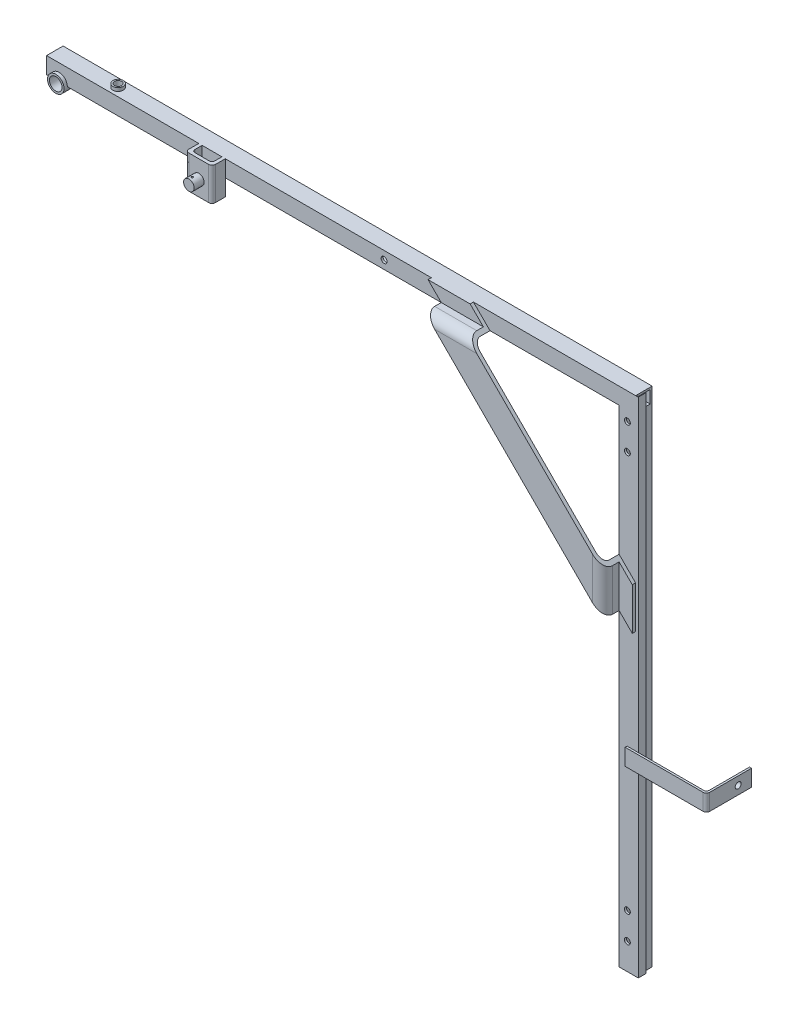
ISO-10303-21;
HEADER;
FILE_DESCRIPTION(('STEP AP214'),'2;1');
FILE_NAME('part.step','',(''),(''),'','','');
FILE_SCHEMA(('AUTOMOTIVE_DESIGN { 1 0 10303 214 1 1 1 1 }'));
ENDSEC;
DATA;
#1=APPLICATION_CONTEXT('core data for automotive mechanical design processes');
#2=APPLICATION_PROTOCOL_DEFINITION('international standard','automotive_design',2000,#1);
#3=PRODUCT_CONTEXT('',#1,'mechanical');
#4=PRODUCT('Part','Part','',(#3));
#5=PRODUCT_RELATED_PRODUCT_CATEGORY('part','',(#4));
#6=PRODUCT_DEFINITION_FORMATION('','',#4);
#7=PRODUCT_DEFINITION_CONTEXT('part definition',#1,'design');
#8=PRODUCT_DEFINITION('design','',#6,#7);
#9=PRODUCT_DEFINITION_SHAPE('','',#8);
#10=(LENGTH_UNIT() NAMED_UNIT(*) SI_UNIT(.MILLI.,.METRE.));
#11=(NAMED_UNIT(*) PLANE_ANGLE_UNIT() SI_UNIT($,.RADIAN.));
#12=(NAMED_UNIT(*) SI_UNIT($,.STERADIAN.) SOLID_ANGLE_UNIT());
#13=UNCERTAINTY_MEASURE_WITH_UNIT(LENGTH_MEASURE(1.E-05),#10,'distance_accuracy_value','');
#14=(GEOMETRIC_REPRESENTATION_CONTEXT(3) GLOBAL_UNCERTAINTY_ASSIGNED_CONTEXT((#13)) GLOBAL_UNIT_ASSIGNED_CONTEXT((#10,
#11,#12)) REPRESENTATION_CONTEXT('',''));
#15=CARTESIAN_POINT('',(0.,0.,0.));
#16=DIRECTION('',(0.,0.,1.));
#17=DIRECTION('',(1.,0.,0.));
#18=AXIS2_PLACEMENT_3D('',#15,#16,#17);
#19=CARTESIAN_POINT('',(0.,12.5,-12.5));
#20=DIRECTION('',(0.,-1.,0.));
#21=DIRECTION('',(0.,0.,-1.));
#22=AXIS2_PLACEMENT_3D('',#19,#20,#21);
#23=PLANE('',#22);
#24=DIRECTION('',(0.,0.,-1.));
#25=VECTOR('',#24,1.);
#26=CARTESIAN_POINT('',(-655.,12.5,12.5));
#27=LINE('',#26,#25);
#28=CARTESIAN_POINT('',(-655.,12.5,23.5));
#29=VERTEX_POINT('',#28);
#30=CARTESIAN_POINT('',(-655.,12.5,12.5));
#31=VERTEX_POINT('',#30);
#32=EDGE_CURVE('E870',#29,#31,#27,.T.);
#33=ORIENTED_EDGE('',*,*,#32,.T.);
#34=DIRECTION('',(-1.,0.,0.));
#35=VECTOR('',#34,1.);
#36=CARTESIAN_POINT('',(0.,12.5,12.5));
#37=LINE('',#36,#35);
#38=CARTESIAN_POINT('',(-625.,12.5,12.5));
#39=VERTEX_POINT('',#38);
#40=EDGE_CURVE('E1171',#39,#31,#37,.T.);
#41=ORIENTED_EDGE('',*,*,#40,.F.);
#42=DIRECTION('',(0.,0.,1.));
#43=VECTOR('',#42,1.);
#44=CARTESIAN_POINT('',(-625.,12.5,23.5));
#45=LINE('',#44,#43);
#46=CARTESIAN_POINT('',(-625.,12.5,23.5));
#47=VERTEX_POINT('',#46);
#48=EDGE_CURVE('E1222',#39,#47,#45,.T.);
#49=ORIENTED_EDGE('',*,*,#48,.T.);
#50=CARTESIAN_POINT('',(-629.,12.5,23.5));
#51=DIRECTION('',(0.,-1.,0.));
#52=DIRECTION('',(0.,0.,-1.));
#53=AXIS2_PLACEMENT_3D('',#50,#51,#52);
#54=CIRCLE('',#53,4.);
#55=CARTESIAN_POINT('',(-629.,12.5,27.5));
#56=VERTEX_POINT('',#55);
#57=EDGE_CURVE('E1218',#47,#56,#54,.T.);
#58=ORIENTED_EDGE('',*,*,#57,.T.);
#59=DIRECTION('',(-1.,0.,0.));
#60=VECTOR('',#59,1.);
#61=CARTESIAN_POINT('',(-651.,12.5,27.5));
#62=LINE('',#61,#60);
#63=CARTESIAN_POINT('',(-651.,12.5,27.5));
#64=VERTEX_POINT('',#63);
#65=EDGE_CURVE('E883',#56,#64,#62,.T.);
#66=ORIENTED_EDGE('',*,*,#65,.T.);
#67=CARTESIAN_POINT('',(-651.,12.5,23.5));
#68=DIRECTION('',(0.,-1.,0.));
#69=DIRECTION('',(0.,0.,-1.));
#70=AXIS2_PLACEMENT_3D('',#67,#68,#69);
#71=CIRCLE('',#70,4.);
#72=EDGE_CURVE('E878',#64,#29,#71,.T.);
#73=ORIENTED_EDGE('',*,*,#72,.T.);
#74=EDGE_LOOP('',(#33,#41,#49,#58,#66,#73));
#75=FACE_BOUND('',#74,.T.);
#76=CARTESIAN_POINT('',(-660.,12.5,12.5));
#77=VERTEX_POINT('',#76);
#78=CARTESIAN_POINT('',(-890.,12.5,12.5));
#79=VERTEX_POINT('',#78);
#80=EDGE_CURVE('E1170',#77,#79,#37,.T.);
#81=ORIENTED_EDGE('',*,*,#80,.F.);
#82=DIRECTION('',(0.,0.,1.));
#83=VECTOR('',#82,1.);
#84=CARTESIAN_POINT('',(-660.,12.5,12.5));
#85=LINE('',#84,#83);
#86=CARTESIAN_POINT('',(-660.,12.5,27.5));
#87=VERTEX_POINT('',#86);
#88=EDGE_CURVE('E1206',#77,#87,#85,.T.);
#89=ORIENTED_EDGE('',*,*,#88,.T.);
#90=CARTESIAN_POINT('',(-655.,12.5,27.5));
#91=DIRECTION('',(0.,1.,0.));
#92=DIRECTION('',(0.,0.,-1.));
#93=AXIS2_PLACEMENT_3D('',#90,#91,#92);
#94=CIRCLE('',#93,5.);
#95=CARTESIAN_POINT('',(-655.,12.5,32.5));
#96=VERTEX_POINT('',#95);
#97=EDGE_CURVE('E1202',#87,#96,#94,.T.);
#98=ORIENTED_EDGE('',*,*,#97,.T.);
#99=DIRECTION('',(1.,0.,0.));
#100=VECTOR('',#99,1.);
#101=CARTESIAN_POINT('',(-655.,12.5,32.5));
#102=LINE('',#101,#100);
#103=CARTESIAN_POINT('',(-625.,12.5,32.5));
#104=VERTEX_POINT('',#103);
#105=EDGE_CURVE('E1197',#96,#104,#102,.T.);
#106=ORIENTED_EDGE('',*,*,#105,.T.);
#107=CARTESIAN_POINT('',(-625.,12.5,27.5));
#108=DIRECTION('',(0.,1.,0.));
#109=DIRECTION('',(0.,0.,-1.));
#110=AXIS2_PLACEMENT_3D('',#107,#108,#109);
#111=CIRCLE('',#110,5.);
#112=CARTESIAN_POINT('',(-620.,12.5,27.5));
#113=VERTEX_POINT('',#112);
#114=EDGE_CURVE('E1193',#104,#113,#111,.T.);
#115=ORIENTED_EDGE('',*,*,#114,.T.);
#116=DIRECTION('',(0.,0.,-1.));
#117=VECTOR('',#116,1.);
#118=CARTESIAN_POINT('',(-620.,12.5,27.5));
#119=LINE('',#118,#117);
#120=CARTESIAN_POINT('',(-620.,12.5,12.5));
#121=VERTEX_POINT('',#120);
#122=EDGE_CURVE('E1233',#113,#121,#119,.T.);
#123=ORIENTED_EDGE('',*,*,#122,.T.);
#124=CARTESIAN_POINT('',(-308.639610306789,12.5,12.5));
#125=VERTEX_POINT('',#124);
#126=EDGE_CURVE('E1229',#125,#121,#37,.T.);
#127=ORIENTED_EDGE('',*,*,#126,.F.);
#128=DIRECTION('',(0.,0.,-1.));
#129=VECTOR('',#128,1.);
#130=CARTESIAN_POINT('',(-308.639610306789,12.5,42.5));
#131=LINE('',#130,#129);
#132=CARTESIAN_POINT('',(-308.639610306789,12.5,17.5));
#133=VERTEX_POINT('',#132);
#134=EDGE_CURVE('E1035',#133,#125,#131,.T.);
#135=ORIENTED_EDGE('',*,*,#134,.F.);
#136=DIRECTION('',(1.,0.,0.));
#137=VECTOR('',#136,1.);
#138=CARTESIAN_POINT('',(0.,12.5,17.5));
#139=LINE('',#138,#137);
#140=CARTESIAN_POINT('',(-245.,12.5,17.5));
#141=VERTEX_POINT('',#140);
#142=EDGE_CURVE('E996',#133,#141,#139,.T.);
#143=ORIENTED_EDGE('',*,*,#142,.T.);
#144=DIRECTION('',(0.,0.,-1.));
#145=VECTOR('',#144,1.);
#146=CARTESIAN_POINT('',(-245.,12.5,42.5));
#147=LINE('',#146,#145);
#148=CARTESIAN_POINT('',(-245.,12.5,12.5));
#149=VERTEX_POINT('',#148);
#150=EDGE_CURVE('E1027',#141,#149,#147,.T.);
#151=ORIENTED_EDGE('',*,*,#150,.T.);
#152=CARTESIAN_POINT('',(4.,12.5000000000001,12.5));
#153=VERTEX_POINT('',#152);
#154=EDGE_CURVE('E1172',#153,#149,#37,.T.);
#155=ORIENTED_EDGE('',*,*,#154,.F.);
#156=DIRECTION('',(0.,0.,1.));
#157=VECTOR('',#156,1.);
#158=CARTESIAN_POINT('',(4.,12.5000000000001,12.5));
#159=LINE('',#158,#157);
#160=CARTESIAN_POINT('',(4.,12.5000000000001,0.499999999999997));
#161=VERTEX_POINT('',#160);
#162=EDGE_CURVE('E440',#161,#153,#159,.T.);
#163=ORIENTED_EDGE('',*,*,#162,.F.);
#164=DIRECTION('',(1.,0.,0.));
#165=VECTOR('',#164,1.);
#166=CARTESIAN_POINT('',(3.,12.5000000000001,0.499999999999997));
#167=LINE('',#166,#165);
#168=CARTESIAN_POINT('',(3.,12.5000000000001,0.499999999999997));
#169=VERTEX_POINT('',#168);
#170=EDGE_CURVE('E1318',#169,#161,#167,.T.);
#171=ORIENTED_EDGE('',*,*,#170,.F.);
#172=DIRECTION('',(0.,0.,-1.));
#173=VECTOR('',#172,1.);
#174=CARTESIAN_POINT('',(3.,12.5000000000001,11.5));
#175=LINE('',#174,#173);
#176=CARTESIAN_POINT('',(3.,12.5000000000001,11.5));
#177=VERTEX_POINT('',#176);
#178=EDGE_CURVE('E1321',#177,#169,#175,.T.);
#179=ORIENTED_EDGE('',*,*,#178,.F.);
#180=DIRECTION('',(1.,0.,0.));
#181=VECTOR('',#180,1.);
#182=CARTESIAN_POINT('',(0.,12.5000000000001,11.5));
#183=LINE('',#182,#181);
#184=CARTESIAN_POINT('',(0.,12.5000000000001,11.5));
#185=VERTEX_POINT('',#184);
#186=EDGE_CURVE('E1324',#185,#177,#183,.T.);
#187=ORIENTED_EDGE('',*,*,#186,.F.);
#188=DIRECTION('',(0.,0.,1.));
#189=VECTOR('',#188,1.);
#190=CARTESIAN_POINT('',(0.,12.5,-12.5));
#191=LINE('',#190,#189);
#192=CARTESIAN_POINT('',(0.,12.5,-12.5));
#193=VERTEX_POINT('',#192);
#194=EDGE_CURVE('E439',#193,#185,#191,.T.);
#195=ORIENTED_EDGE('',*,*,#194,.F.);
#196=DIRECTION('',(-1.,0.,0.));
#197=VECTOR('',#196,1.);
#198=CARTESIAN_POINT('',(0.,12.5,-12.5));
#199=LINE('',#198,#197);
#200=CARTESIAN_POINT('',(-890.,12.5,-12.5));
#201=VERTEX_POINT('',#200);
#202=EDGE_CURVE('E506',#193,#201,#199,.T.);
#203=ORIENTED_EDGE('',*,*,#202,.T.);
#204=DIRECTION('',(0.,0.,1.));
#205=VECTOR('',#204,1.);
#206=CARTESIAN_POINT('',(-890.,12.5,-12.5));
#207=LINE('',#206,#205);
#208=EDGE_CURVE('E465',#201,#79,#207,.T.);
#209=ORIENTED_EDGE('',*,*,#208,.T.);
#210=EDGE_LOOP('',(#81,#89,#98,#106,#115,#123,#127,#135,#143,#151,#155,#163,#171,#179,#187,#195,
#203,#209));
#211=FACE_BOUND('',#210,.T.);
#212=CARTESIAN_POINT('',(-794.472118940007,12.5,0.));
#213=DIRECTION('',(0.,-1.,0.));
#214=DIRECTION('',(0.,0.,-1.));
#215=AXIS2_PLACEMENT_3D('',#212,#213,#214);
#216=CIRCLE('',#215,7.80265197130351);
#217=CARTESIAN_POINT('',(-794.472118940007,12.5,-7.80265197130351));
#218=VERTEX_POINT('',#217);
#219=EDGE_CURVE('E12',#218,#218,#216,.F.);
#220=ORIENTED_EDGE('',*,*,#219,.F.);
#221=EDGE_LOOP('',(#220));
#222=FACE_BOUND('',#221,.T.);
#223=ADVANCED_FACE('F28',(#75,#211,#222),#23,.F.);
#224=CARTESIAN_POINT('',(0.,12.5,-12.5));
#225=DIRECTION('',(-1.,0.,0.));
#226=DIRECTION('',(0.,0.,1.));
#227=AXIS2_PLACEMENT_3D('',#224,#225,#226);
#228=PLANE('',#227);
#229=DIRECTION('',(0.,0.,-1.));
#230=VECTOR('',#229,1.);
#231=CARTESIAN_POINT('',(0.,-296.139610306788,42.5));
#232=LINE('',#231,#230);
#233=CARTESIAN_POINT('',(0.,-296.139610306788,17.5));
#234=VERTEX_POINT('',#233);
#235=CARTESIAN_POINT('',(0.,-296.139610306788,12.5));
#236=VERTEX_POINT('',#235);
#237=EDGE_CURVE('E1032',#234,#236,#232,.T.);
#238=ORIENTED_EDGE('',*,*,#237,.T.);
#239=DIRECTION('',(0.,-1.,0.));
#240=VECTOR('',#239,1.);
#241=CARTESIAN_POINT('',(0.,12.5000000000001,12.5));
#242=LINE('',#241,#240);
#243=CARTESIAN_POINT('',(0.,-232.499999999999,12.5));
#244=VERTEX_POINT('',#243);
#245=EDGE_CURVE('E1303',#244,#236,#242,.T.);
#246=ORIENTED_EDGE('',*,*,#245,.F.);
#247=DIRECTION('',(0.,0.,-1.));
#248=VECTOR('',#247,1.);
#249=CARTESIAN_POINT('',(0.,-232.499999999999,42.5));
#250=LINE('',#249,#248);
#251=CARTESIAN_POINT('',(0.,-232.499999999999,17.5));
#252=VERTEX_POINT('',#251);
#253=EDGE_CURVE('E1029',#252,#244,#250,.T.);
#254=ORIENTED_EDGE('',*,*,#253,.F.);
#255=DIRECTION('',(0.,-1.,0.));
#256=VECTOR('',#255,1.);
#257=CARTESIAN_POINT('',(0.,12.5,17.5));
#258=LINE('',#257,#256);
#259=EDGE_CURVE('E972',#252,#234,#258,.T.);
#260=ORIENTED_EDGE('',*,*,#259,.T.);
#261=EDGE_LOOP('',(#238,#246,#254,#260));
#262=FACE_BOUND('',#261,.T.);
#263=ADVANCED_FACE('F659',(#262),#228,.F.);
#264=CARTESIAN_POINT('',(110.,-452.5,12.5));
#265=DIRECTION('',(0.,0.,-1.));
#266=DIRECTION('',(-1.,0.,0.));
#267=AXIS2_PLACEMENT_3D('',#264,#265,#266);
#268=PLANE('',#267);
#269=DIRECTION('',(0.,-1.,0.));
#270=VECTOR('',#269,1.);
#271=CARTESIAN_POINT('',(4.,12.5000000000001,12.5));
#272=LINE('',#271,#270);
#273=CARTESIAN_POINT('',(4.,-452.5,12.5));
#274=VERTEX_POINT('',#273);
#275=CARTESIAN_POINT('',(4.,-477.5,12.5));
#276=VERTEX_POINT('',#275);
#277=EDGE_CURVE('E1314',#274,#276,#272,.T.);
#278=ORIENTED_EDGE('',*,*,#277,.F.);
#279=DIRECTION('',(-1.,0.,0.));
#280=VECTOR('',#279,1.);
#281=CARTESIAN_POINT('',(110.,-452.5,12.5));
#282=LINE('',#281,#280);
#283=CARTESIAN_POINT('',(103.,-452.5,12.5));
#284=VERTEX_POINT('',#283);
#285=EDGE_CURVE('E1272',#284,#274,#282,.T.);
#286=ORIENTED_EDGE('',*,*,#285,.F.);
#287=DIRECTION('',(0.,1.,0.));
#288=VECTOR('',#287,1.);
#289=CARTESIAN_POINT('',(103.,-452.5,12.5));
#290=LINE('',#289,#288);
#291=CARTESIAN_POINT('',(103.,-477.5,12.5));
#292=VERTEX_POINT('',#291);
#293=EDGE_CURVE('E1454',#284,#292,#290,.F.);
#294=ORIENTED_EDGE('',*,*,#293,.T.);
#295=DIRECTION('',(1.,0.,0.));
#296=VECTOR('',#295,1.);
#297=CARTESIAN_POINT('',(110.,-477.5,12.5));
#298=LINE('',#297,#296);
#299=EDGE_CURVE('E1269',#276,#292,#298,.T.);
#300=ORIENTED_EDGE('',*,*,#299,.F.);
#301=EDGE_LOOP('',(#278,#286,#294,#300));
#302=FACE_BOUND('',#301,.T.);
#303=ADVANCED_FACE('F666',(#302),#268,.T.);
#304=CARTESIAN_POINT('',(0.,12.5,12.5));
#305=DIRECTION('',(0.,0.,-1.));
#306=DIRECTION('',(-1.,0.,0.));
#307=AXIS2_PLACEMENT_3D('',#304,#305,#306);
#308=PLANE('',#307);
#309=ORIENTED_EDGE('',*,*,#40,.T.);
#310=DIRECTION('',(0.,1.,0.));
#311=VECTOR('',#310,1.);
#312=CARTESIAN_POINT('',(-655.,-37.5,12.5));
#313=LINE('',#312,#311);
#314=CARTESIAN_POINT('',(-655.,-12.5,12.5));
#315=VERTEX_POINT('',#314);
#316=EDGE_CURVE('E875',#315,#31,#313,.T.);
#317=ORIENTED_EDGE('',*,*,#316,.F.);
#318=DIRECTION('',(-1.,0.,0.));
#319=VECTOR('',#318,1.);
#320=CARTESIAN_POINT('',(0.,-12.5,12.5));
#321=LINE('',#320,#319);
#322=CARTESIAN_POINT('',(-625.,-12.5,12.5));
#323=VERTEX_POINT('',#322);
#324=EDGE_CURVE('E610',#323,#315,#321,.T.);
#325=ORIENTED_EDGE('',*,*,#324,.F.);
#326=DIRECTION('',(0.,1.,0.));
#327=VECTOR('',#326,1.);
#328=CARTESIAN_POINT('',(-625.,-37.5,12.5));
#329=LINE('',#328,#327);
#330=EDGE_CURVE('E931',#323,#39,#329,.T.);
#331=ORIENTED_EDGE('',*,*,#330,.T.);
#332=EDGE_LOOP('',(#309,#317,#325,#331));
#333=FACE_BOUND('',#332,.T.);
#334=ADVANCED_FACE('F678',(#333),#308,.F.);
#335=CARTESIAN_POINT('',(-380.,0.,12.5));
#336=DIRECTION('',(0.,0.,1.));
#337=DIRECTION('',(1.,0.,0.));
#338=AXIS2_PLACEMENT_3D('',#335,#336,#337);
#339=CIRCLE('',#338,4.50000000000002);
#340=CARTESIAN_POINT('',(-375.5,0.,12.5));
#341=VERTEX_POINT('',#340);
#342=EDGE_CURVE('E554',#341,#341,#339,.T.);
#343=ORIENTED_EDGE('',*,*,#342,.F.);
#344=EDGE_LOOP('',(#343));
#345=FACE_BOUND('',#344,.T.);
#346=ORIENTED_EDGE('',*,*,#126,.T.);
#347=DIRECTION('',(0.,1.,0.));
#348=VECTOR('',#347,1.);
#349=CARTESIAN_POINT('',(-620.,-37.5,12.5));
#350=LINE('',#349,#348);
#351=CARTESIAN_POINT('',(-620.,-12.5,12.5));
#352=VERTEX_POINT('',#351);
#353=EDGE_CURVE('E935',#352,#121,#350,.T.);
#354=ORIENTED_EDGE('',*,*,#353,.F.);
#355=CARTESIAN_POINT('',(-283.639610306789,-12.5,12.5));
#356=VERTEX_POINT('',#355);
#357=EDGE_CURVE('E558',#356,#352,#321,.T.);
#358=ORIENTED_EDGE('',*,*,#357,.F.);
#359=DIRECTION('',(0.707106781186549,-0.707106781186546,0.));
#360=VECTOR('',#359,1.);
#361=CARTESIAN_POINT('',(-308.639610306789,12.5,12.5));
#362=LINE('',#361,#360);
#363=EDGE_CURVE('E1015',#125,#356,#362,.T.);
#364=ORIENTED_EDGE('',*,*,#363,.F.);
#365=EDGE_LOOP('',(#346,#354,#358,#364));
#366=FACE_BOUND('',#365,.T.);
#367=ADVANCED_FACE('F781',(#345,#366),#308,.F.);
#368=CARTESIAN_POINT('',(0.,12.5,42.5));
#369=DIRECTION('',(0.,0.,-1.));
#370=DIRECTION('',(-1.,0.,0.));
#371=AXIS2_PLACEMENT_3D('',#368,#369,#370);
#372=PLANE('',#371);
#373=DIRECTION('',(0.707106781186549,-0.707106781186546,0.));
#374=VECTOR('',#373,1.);
#375=CARTESIAN_POINT('',(-308.639610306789,12.5,42.5));
#376=LINE('',#375,#374);
#377=CARTESIAN_POINT('',(-273.639610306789,-22.5,42.5));
#378=VERTEX_POINT('',#377);
#379=CARTESIAN_POINT('',(-35.4563880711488,-260.68322223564,42.5));
#380=VERTEX_POINT('',#379);
#381=EDGE_CURVE('E1022',#378,#380,#376,.T.);
#382=ORIENTED_EDGE('',*,*,#381,.T.);
#383=DIRECTION('',(0.,1.,0.));
#384=VECTOR('',#383,1.);
#385=CARTESIAN_POINT('',(-35.4563880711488,12.5,42.5));
#386=LINE('',#385,#384);
#387=CARTESIAN_POINT('',(-35.4563880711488,-197.04361192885,42.5));
#388=VERTEX_POINT('',#387);
#389=EDGE_CURVE('E600',#380,#388,#386,.T.);
#390=ORIENTED_EDGE('',*,*,#389,.T.);
#391=DIRECTION('',(-0.707106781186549,0.707106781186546,0.));
#392=VECTOR('',#391,1.);
#393=CARTESIAN_POINT('',(-245.,12.5,42.5));
#394=LINE('',#393,#392);
#395=CARTESIAN_POINT('',(-210.,-22.5,42.5));
#396=VERTEX_POINT('',#395);
#397=EDGE_CURVE('E1025',#388,#396,#394,.T.);
#398=ORIENTED_EDGE('',*,*,#397,.T.);
#399=DIRECTION('',(1.,0.,0.));
#400=VECTOR('',#399,1.);
#401=CARTESIAN_POINT('',(-415.,-22.5,42.5));
#402=LINE('',#401,#400);
#403=EDGE_CURVE('E591',#396,#378,#402,.F.);
#404=ORIENTED_EDGE('',*,*,#403,.T.);
#405=EDGE_LOOP('',(#382,#390,#398,#404));
#406=FACE_BOUND('',#405,.T.);
#407=ADVANCED_FACE('F676',(#406),#372,.F.);
#408=CARTESIAN_POINT('',(-660.,-12.5,12.5));
#409=VERTEX_POINT('',#408);
#410=CARTESIAN_POINT('',(-858.607379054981,-12.5,12.5));
#411=VERTEX_POINT('',#410);
#412=EDGE_CURVE('E613',#409,#411,#321,.T.);
#413=ORIENTED_EDGE('',*,*,#412,.F.);
#414=DIRECTION('',(0.,1.,0.));
#415=VECTOR('',#414,1.);
#416=CARTESIAN_POINT('',(-660.,-37.5,12.5));
#417=LINE('',#416,#415);
#418=EDGE_CURVE('E917',#409,#77,#417,.T.);
#419=ORIENTED_EDGE('',*,*,#418,.T.);
#420=ORIENTED_EDGE('',*,*,#80,.T.);
#421=DIRECTION('',(0.,-1.,0.));
#422=VECTOR('',#421,1.);
#423=CARTESIAN_POINT('',(-890.,12.5,12.5));
#424=LINE('',#423,#422);
#425=CARTESIAN_POINT('',(-890.,-12.5,12.5));
#426=VERTEX_POINT('',#425);
#427=EDGE_CURVE('E469',#79,#426,#424,.T.);
#428=ORIENTED_EDGE('',*,*,#427,.T.);
#429=CARTESIAN_POINT('',(-883.607379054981,-12.5,12.5));
#430=VERTEX_POINT('',#429);
#431=EDGE_CURVE('E528',#430,#426,#321,.T.);
#432=ORIENTED_EDGE('',*,*,#431,.F.);
#433=CARTESIAN_POINT('',(-871.107379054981,-12.5,12.5));
#434=DIRECTION('',(0.,0.,1.));
#435=DIRECTION('',(1.,0.,0.));
#436=AXIS2_PLACEMENT_3D('',#433,#434,#435);
#437=CIRCLE('',#436,12.5);
#438=EDGE_CURVE('E1084',#411,#430,#437,.T.);
#439=ORIENTED_EDGE('',*,*,#438,.F.);
#440=EDGE_LOOP('',(#413,#419,#420,#428,#432,#439));
#441=FACE_BOUND('',#440,.T.);
#442=ADVANCED_FACE('F672',(#441),#308,.F.);
#443=CARTESIAN_POINT('',(-12.5,-67.5,12.5));
#444=DIRECTION('',(0.,0.,1.));
#445=DIRECTION('',(1.,0.,0.));
#446=AXIS2_PLACEMENT_3D('',#443,#444,#445);
#447=CIRCLE('',#446,4.50000000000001);
#448=CARTESIAN_POINT('',(-7.99999999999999,-67.5,12.5));
#449=VERTEX_POINT('',#448);
#450=EDGE_CURVE('E539',#449,#449,#447,.T.);
#451=ORIENTED_EDGE('',*,*,#450,.F.);
#452=EDGE_LOOP('',(#451));
#453=FACE_BOUND('',#452,.T.);
#454=CARTESIAN_POINT('',(-12.5,-27.5,12.5));
#455=DIRECTION('',(0.,0.,1.));
#456=DIRECTION('',(1.,0.,0.));
#457=AXIS2_PLACEMENT_3D('',#454,#455,#456);
#458=CIRCLE('',#457,4.5);
#459=CARTESIAN_POINT('',(-8.,-27.5,12.5));
#460=VERTEX_POINT('',#459);
#461=EDGE_CURVE('E534',#460,#460,#458,.T.);
#462=ORIENTED_EDGE('',*,*,#461,.F.);
#463=EDGE_LOOP('',(#462));
#464=FACE_BOUND('',#463,.T.);
#465=DIRECTION('',(-0.707106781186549,0.707106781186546,0.));
#466=VECTOR('',#465,1.);
#467=CARTESIAN_POINT('',(-245.,12.5,12.5));
#468=LINE('',#467,#466);
#469=CARTESIAN_POINT('',(-25.,-207.499999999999,12.5));
#470=VERTEX_POINT('',#469);
#471=EDGE_CURVE('E1019',#244,#470,#468,.T.);
#472=ORIENTED_EDGE('',*,*,#471,.F.);
#473=ORIENTED_EDGE('',*,*,#245,.T.);
#474=CARTESIAN_POINT('',(-25.,-271.139610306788,12.5));
#475=VERTEX_POINT('',#474);
#476=EDGE_CURVE('E1009',#475,#236,#362,.T.);
#477=ORIENTED_EDGE('',*,*,#476,.F.);
#478=DIRECTION('',(0.,1.,0.));
#479=VECTOR('',#478,1.);
#480=CARTESIAN_POINT('',(-25.,-747.5,12.5));
#481=LINE('',#480,#479);
#482=CARTESIAN_POINT('',(-25.,-747.5,12.5));
#483=VERTEX_POINT('',#482);
#484=EDGE_CURVE('E466',#483,#475,#481,.T.);
#485=ORIENTED_EDGE('',*,*,#484,.F.);
#486=DIRECTION('',(-1.,0.,0.));
#487=VECTOR('',#486,1.);
#488=CARTESIAN_POINT('',(0.,-747.5,12.5));
#489=LINE('',#488,#487);
#490=CARTESIAN_POINT('',(4.,-747.5,12.5));
#491=VERTEX_POINT('',#490);
#492=EDGE_CURVE('E447',#491,#483,#489,.T.);
#493=ORIENTED_EDGE('',*,*,#492,.F.);
#494=EDGE_CURVE('E1310',#276,#491,#272,.T.);
#495=ORIENTED_EDGE('',*,*,#494,.F.);
#496=CARTESIAN_POINT('',(-12.8389350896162,-477.5,12.5));
#497=VERTEX_POINT('',#496);
#498=EDGE_CURVE('E43',#497,#276,#298,.T.);
#499=ORIENTED_EDGE('',*,*,#498,.F.);
#500=DIRECTION('',(0.,-1.,0.));
#501=VECTOR('',#500,1.);
#502=CARTESIAN_POINT('',(-12.8389350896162,-452.5,12.5));
#503=LINE('',#502,#501);
#504=CARTESIAN_POINT('',(-12.8389350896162,-452.5,12.5));
#505=VERTEX_POINT('',#504);
#506=EDGE_CURVE('E1270',#505,#497,#503,.T.);
#507=ORIENTED_EDGE('',*,*,#506,.F.);
#508=EDGE_CURVE('E1275',#274,#505,#282,.T.);
#509=ORIENTED_EDGE('',*,*,#508,.F.);
#510=EDGE_CURVE('E1311',#153,#274,#272,.T.);
#511=ORIENTED_EDGE('',*,*,#510,.F.);
#512=ORIENTED_EDGE('',*,*,#154,.T.);
#513=CARTESIAN_POINT('',(-220.,-12.5,12.5));
#514=VERTEX_POINT('',#513);
#515=EDGE_CURVE('E1018',#514,#149,#468,.T.);
#516=ORIENTED_EDGE('',*,*,#515,.F.);
#517=CARTESIAN_POINT('',(-25.,-12.5,12.5));
#518=VERTEX_POINT('',#517);
#519=EDGE_CURVE('E1167',#518,#514,#321,.T.);
#520=ORIENTED_EDGE('',*,*,#519,.F.);
#521=EDGE_CURVE('E555',#470,#518,#481,.T.);
#522=ORIENTED_EDGE('',*,*,#521,.F.);
#523=EDGE_LOOP('',(#472,#473,#477,#485,#493,#495,#499,#507,#509,#511,#512,#516,#520,#522));
#524=FACE_BOUND('',#523,.T.);
#525=CARTESIAN_POINT('',(-12.5,-707.5,12.5));
#526=DIRECTION('',(0.,0.,1.));
#527=DIRECTION('',(1.,0.,0.));
#528=AXIS2_PLACEMENT_3D('',#525,#526,#527);
#529=CIRCLE('',#528,4.5);
#530=CARTESIAN_POINT('',(-8.,-707.5,12.5));
#531=VERTEX_POINT('',#530);
#532=EDGE_CURVE('E544',#531,#531,#529,.T.);
#533=ORIENTED_EDGE('',*,*,#532,.F.);
#534=EDGE_LOOP('',(#533));
#535=FACE_BOUND('',#534,.T.);
#536=CARTESIAN_POINT('',(-12.5,-667.5,12.5));
#537=DIRECTION('',(0.,0.,1.));
#538=DIRECTION('',(1.,0.,0.));
#539=AXIS2_PLACEMENT_3D('',#536,#537,#538);
#540=CIRCLE('',#539,4.5);
#541=CARTESIAN_POINT('',(-8.,-667.5,12.5));
#542=VERTEX_POINT('',#541);
#543=EDGE_CURVE('E549',#542,#542,#540,.T.);
#544=ORIENTED_EDGE('',*,*,#543,.F.);
#545=EDGE_LOOP('',(#544));
#546=FACE_BOUND('',#545,.T.);
#547=ADVANCED_FACE('F675',(#453,#464,#524,#535,#546),#308,.F.);
#548=CARTESIAN_POINT('',(0.,-12.5,-12.5));
#549=DIRECTION('',(0.,1.,0.));
#550=DIRECTION('',(0.,0.,1.));
#551=AXIS2_PLACEMENT_3D('',#548,#549,#550);
#552=PLANE('',#551);
#553=DIRECTION('',(-1.,0.,0.));
#554=VECTOR('',#553,1.);
#555=CARTESIAN_POINT('',(0.,-12.5,-12.5));
#556=LINE('',#555,#554);
#557=CARTESIAN_POINT('',(-883.607379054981,-12.5,-12.5));
#558=VERTEX_POINT('',#557);
#559=CARTESIAN_POINT('',(-890.,-12.5,-12.5));
#560=VERTEX_POINT('',#559);
#561=EDGE_CURVE('E502',#558,#560,#556,.T.);
#562=ORIENTED_EDGE('',*,*,#561,.F.);
#563=DIRECTION('',(0.,0.,1.));
#564=VECTOR('',#563,1.);
#565=CARTESIAN_POINT('',(-883.607379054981,-12.5,-12.50005));
#566=LINE('',#565,#564);
#567=EDGE_CURVE('E1098',#558,#430,#566,.T.);
#568=ORIENTED_EDGE('',*,*,#567,.T.);
#569=ORIENTED_EDGE('',*,*,#431,.T.);
#570=DIRECTION('',(0.,0.,-1.));
#571=VECTOR('',#570,1.);
#572=CARTESIAN_POINT('',(-890.,-12.5,-12.5));
#573=LINE('',#572,#571);
#574=EDGE_CURVE('E472',#426,#560,#573,.T.);
#575=ORIENTED_EDGE('',*,*,#574,.T.);
#576=EDGE_LOOP('',(#562,#568,#569,#575));
#577=FACE_BOUND('',#576,.T.);
#578=ADVANCED_FACE('F685',(#577),#552,.F.);
#579=CARTESIAN_POINT('',(0.,-9.5,-9.50000000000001));
#580=DIRECTION('',(0.,1.,0.));
#581=DIRECTION('',(0.,0.,1.));
#582=AXIS2_PLACEMENT_3D('',#579,#580,#581);
#583=PLANE('',#582);
#584=DIRECTION('',(0.,0.,1.));
#585=VECTOR('',#584,1.);
#586=CARTESIAN_POINT('',(-883.242040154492,-9.5,-12.50005));
#587=LINE('',#586,#585);
#588=CARTESIAN_POINT('',(-883.242040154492,-9.5,-9.50000000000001));
#589=VERTEX_POINT('',#588);
#590=CARTESIAN_POINT('',(-883.242040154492,-9.5,9.5));
#591=VERTEX_POINT('',#590);
#592=EDGE_CURVE('E1089',#589,#591,#587,.T.);
#593=ORIENTED_EDGE('',*,*,#592,.F.);
#594=DIRECTION('',(-1.,0.,0.));
#595=VECTOR('',#594,1.);
#596=CARTESIAN_POINT('',(0.,-9.5,-9.50000000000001));
#597=LINE('',#596,#595);
#598=CARTESIAN_POINT('',(-890.,-9.5,-9.50000000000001));
#599=VERTEX_POINT('',#598);
#600=EDGE_CURVE('E509',#589,#599,#597,.T.);
#601=ORIENTED_EDGE('',*,*,#600,.T.);
#602=DIRECTION('',(0.,0.,-1.));
#603=VECTOR('',#602,1.);
#604=CARTESIAN_POINT('',(-890.,-9.5,-9.50000000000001));
#605=LINE('',#604,#603);
#606=CARTESIAN_POINT('',(-890.,-9.5,9.5));
#607=VERTEX_POINT('',#606);
#608=EDGE_CURVE('E481',#607,#599,#605,.T.);
#609=ORIENTED_EDGE('',*,*,#608,.F.);
#610=DIRECTION('',(-1.,0.,0.));
#611=VECTOR('',#610,1.);
#612=CARTESIAN_POINT('',(0.,-9.5,9.5));
#613=LINE('',#612,#611);
#614=EDGE_CURVE('E505',#591,#607,#613,.T.);
#615=ORIENTED_EDGE('',*,*,#614,.F.);
#616=EDGE_LOOP('',(#593,#601,#609,#615));
#617=FACE_BOUND('',#616,.T.);
#618=ADVANCED_FACE('F699',(#617),#583,.T.);
#619=CARTESIAN_POINT('',(-794.472118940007,-12.5,0.));
#620=DIRECTION('',(0.,1.,0.));
#621=DIRECTION('',(0.,0.,1.));
#622=AXIS2_PLACEMENT_3D('',#619,#620,#621);
#623=CIRCLE('',#622,5.49999999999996);
#624=CARTESIAN_POINT('',(-794.472118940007,-12.5,5.49999999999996));
#625=VERTEX_POINT('',#624);
#626=EDGE_CURVE('E1335',#625,#625,#623,.T.);
#627=ORIENTED_EDGE('',*,*,#626,.T.);
#628=EDGE_LOOP('',(#627));
#629=FACE_BOUND('',#628,.T.);
#630=DIRECTION('',(0.,0.,-1.));
#631=VECTOR('',#630,1.);
#632=CARTESIAN_POINT('',(-220.,-12.5,37.5));
#633=LINE('',#632,#631);
#634=CARTESIAN_POINT('',(-220.,-12.5,27.5));
#635=VERTEX_POINT('',#634);
#636=EDGE_CURVE('E1012',#635,#514,#633,.T.);
#637=ORIENTED_EDGE('',*,*,#636,.F.);
#638=DIRECTION('',(1.,0.,0.));
#639=VECTOR('',#638,1.);
#640=CARTESIAN_POINT('',(-283.639610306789,-12.5,27.5));
#641=LINE('',#640,#639);
#642=CARTESIAN_POINT('',(-283.639610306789,-12.5,27.5));
#643=VERTEX_POINT('',#642);
#644=EDGE_CURVE('E570',#635,#643,#641,.F.);
#645=ORIENTED_EDGE('',*,*,#644,.T.);
#646=DIRECTION('',(0.,0.,-1.));
#647=VECTOR('',#646,1.);
#648=CARTESIAN_POINT('',(-283.639610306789,-12.5,37.5));
#649=LINE('',#648,#647);
#650=EDGE_CURVE('E1006',#643,#356,#649,.T.);
#651=ORIENTED_EDGE('',*,*,#650,.T.);
#652=ORIENTED_EDGE('',*,*,#357,.T.);
#653=DIRECTION('',(-1.,0.,0.));
#654=VECTOR('',#653,1.);
#655=CARTESIAN_POINT('',(0.,-12.5,12.5));
#656=LINE('',#655,#654);
#657=EDGE_CURVE('E920',#352,#323,#656,.T.);
#658=ORIENTED_EDGE('',*,*,#657,.T.);
#659=ORIENTED_EDGE('',*,*,#324,.T.);
#660=DIRECTION('',(-1.,0.,0.));
#661=VECTOR('',#660,1.);
#662=CARTESIAN_POINT('',(0.,-12.5,12.5));
#663=LINE('',#662,#661);
#664=EDGE_CURVE('E949',#315,#409,#663,.T.);
#665=ORIENTED_EDGE('',*,*,#664,.T.);
#666=ORIENTED_EDGE('',*,*,#412,.T.);
#667=DIRECTION('',(0.,0.,1.));
#668=VECTOR('',#667,1.);
#669=CARTESIAN_POINT('',(-858.607379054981,-12.5,-12.50005));
#670=LINE('',#669,#668);
#671=CARTESIAN_POINT('',(-858.607379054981,-12.5,-12.5));
#672=VERTEX_POINT('',#671);
#673=EDGE_CURVE('E1096',#411,#672,#670,.F.);
#674=ORIENTED_EDGE('',*,*,#673,.T.);
#675=CARTESIAN_POINT('',(-25.,-12.5,-12.5));
#676=VERTEX_POINT('',#675);
#677=EDGE_CURVE('E522',#676,#672,#556,.T.);
#678=ORIENTED_EDGE('',*,*,#677,.F.);
#679=DIRECTION('',(0.,0.,-1.));
#680=VECTOR('',#679,1.);
#681=CARTESIAN_POINT('',(-25.,-12.5,12.5));
#682=LINE('',#681,#680);
#683=EDGE_CURVE('E448',#518,#676,#682,.T.);
#684=ORIENTED_EDGE('',*,*,#683,.F.);
#685=ORIENTED_EDGE('',*,*,#519,.T.);
#686=EDGE_LOOP('',(#637,#645,#651,#652,#658,#659,#665,#666,#674,#678,#684,#685));
#687=FACE_BOUND('',#686,.T.);
#688=ADVANCED_FACE('F686',(#629,#687),#552,.F.);
#689=CARTESIAN_POINT('',(0.,9.5,-9.5));
#690=DIRECTION('',(0.,-1.,0.));
#691=DIRECTION('',(0.,0.,-1.));
#692=AXIS2_PLACEMENT_3D('',#689,#690,#691);
#693=PLANE('',#692);
#694=CARTESIAN_POINT('',(-794.472118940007,9.49999999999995,0.));
#695=DIRECTION('',(0.,-1.,0.));
#696=DIRECTION('',(0.,0.,-1.));
#697=AXIS2_PLACEMENT_3D('',#694,#695,#696);
#698=CIRCLE('',#697,5.49999999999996);
#699=CARTESIAN_POINT('',(-794.472118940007,9.49999999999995,-5.49999999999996));
#700=VERTEX_POINT('',#699);
#701=EDGE_CURVE('E1338',#700,#700,#698,.T.);
#702=ORIENTED_EDGE('',*,*,#701,.F.);
#703=EDGE_LOOP('',(#702));
#704=FACE_BOUND('',#703,.T.);
#705=DIRECTION('',(0.,0.,1.));
#706=VECTOR('',#705,1.);
#707=CARTESIAN_POINT('',(-890.,9.5,-9.5));
#708=LINE('',#707,#706);
#709=CARTESIAN_POINT('',(-890.,9.5,-9.5));
#710=VERTEX_POINT('',#709);
#711=CARTESIAN_POINT('',(-890.,9.5,9.5));
#712=VERTEX_POINT('',#711);
#713=EDGE_CURVE('E475',#710,#712,#708,.T.);
#714=ORIENTED_EDGE('',*,*,#713,.F.);
#715=DIRECTION('',(-1.,0.,0.));
#716=VECTOR('',#715,1.);
#717=CARTESIAN_POINT('',(0.,9.5,-9.5));
#718=LINE('',#717,#716);
#719=CARTESIAN_POINT('',(0.,9.5,-9.5));
#720=VERTEX_POINT('',#719);
#721=EDGE_CURVE('E513',#720,#710,#718,.T.);
#722=ORIENTED_EDGE('',*,*,#721,.F.);
#723=DIRECTION('',(0.,0.,1.));
#724=VECTOR('',#723,1.);
#725=CARTESIAN_POINT('',(0.,9.5,-9.5));
#726=LINE('',#725,#724);
#727=CARTESIAN_POINT('',(0.,9.5,9.5));
#728=VERTEX_POINT('',#727);
#729=EDGE_CURVE('E490',#720,#728,#726,.T.);
#730=ORIENTED_EDGE('',*,*,#729,.T.);
#731=DIRECTION('',(-1.,0.,0.));
#732=VECTOR('',#731,1.);
#733=CARTESIAN_POINT('',(0.,9.5,9.5));
#734=LINE('',#733,#732);
#735=EDGE_CURVE('E503',#728,#712,#734,.T.);
#736=ORIENTED_EDGE('',*,*,#735,.T.);
#737=EDGE_LOOP('',(#714,#722,#730,#736));
#738=FACE_BOUND('',#737,.T.);
#739=ADVANCED_FACE('F687',(#704,#738),#693,.T.);
#740=CARTESIAN_POINT('',(0.,9.5,-9.5));
#741=DIRECTION('',(0.,0.,1.));
#742=DIRECTION('',(0.,-1.,0.));
#743=AXIS2_PLACEMENT_3D('',#740,#741,#742);
#744=PLANE('',#743);
#745=CARTESIAN_POINT('',(-380.,0.,-9.5));
#746=DIRECTION('',(0.,0.,1.));
#747=DIRECTION('',(0.,-1.,0.));
#748=AXIS2_PLACEMENT_3D('',#745,#746,#747);
#749=CIRCLE('',#748,4.50000000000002);
#750=CARTESIAN_POINT('',(-380.,-4.50000000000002,-9.5));
#751=VERTEX_POINT('',#750);
#752=EDGE_CURVE('E1041',#751,#751,#749,.T.);
#753=ORIENTED_EDGE('',*,*,#752,.F.);
#754=EDGE_LOOP('',(#753));
#755=FACE_BOUND('',#754,.T.);
#756=CARTESIAN_POINT('',(-871.107379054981,-12.5,-9.50000000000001));
#757=DIRECTION('',(0.,0.,1.));
#758=DIRECTION('',(0.,-1.,0.));
#759=AXIS2_PLACEMENT_3D('',#756,#757,#758);
#760=CIRCLE('',#759,12.5);
#761=CARTESIAN_POINT('',(-858.972717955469,-9.5,-9.50000000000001));
#762=VERTEX_POINT('',#761);
#763=EDGE_CURVE('E1091',#762,#589,#760,.T.);
#764=ORIENTED_EDGE('',*,*,#763,.F.);
#765=CARTESIAN_POINT('',(0.,-9.5,-9.50000000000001));
#766=VERTEX_POINT('',#765);
#767=EDGE_CURVE('E510',#766,#762,#597,.T.);
#768=ORIENTED_EDGE('',*,*,#767,.F.);
#769=DIRECTION('',(0.,1.,0.));
#770=VECTOR('',#769,1.);
#771=CARTESIAN_POINT('',(0.,9.5,-9.5));
#772=LINE('',#771,#770);
#773=EDGE_CURVE('E493',#766,#720,#772,.T.);
#774=ORIENTED_EDGE('',*,*,#773,.T.);
#775=ORIENTED_EDGE('',*,*,#721,.T.);
#776=DIRECTION('',(0.,1.,0.));
#777=VECTOR('',#776,1.);
#778=CARTESIAN_POINT('',(-890.,9.5,-9.5));
#779=LINE('',#778,#777);
#780=EDGE_CURVE('E478',#599,#710,#779,.T.);
#781=ORIENTED_EDGE('',*,*,#780,.F.);
#782=ORIENTED_EDGE('',*,*,#600,.F.);
#783=EDGE_LOOP('',(#764,#768,#774,#775,#781,#782));
#784=FACE_BOUND('',#783,.T.);
#785=ADVANCED_FACE('F690',(#755,#784),#744,.T.);
#786=CARTESIAN_POINT('',(-794.472118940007,-9.49999999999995,0.));
#787=DIRECTION('',(0.,1.,0.));
#788=DIRECTION('',(0.,0.,1.));
#789=AXIS2_PLACEMENT_3D('',#786,#787,#788);
#790=CIRCLE('',#789,5.49999999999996);
#791=CARTESIAN_POINT('',(-794.472118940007,-9.49999999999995,5.49999999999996));
#792=VERTEX_POINT('',#791);
#793=EDGE_CURVE('E1341',#792,#792,#790,.T.);
#794=ORIENTED_EDGE('',*,*,#793,.F.);
#795=EDGE_LOOP('',(#794));
#796=FACE_BOUND('',#795,.T.);
#797=DIRECTION('',(0.,0.,1.));
#798=VECTOR('',#797,1.);
#799=CARTESIAN_POINT('',(-858.972717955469,-9.5,-12.50005));
#800=LINE('',#799,#798);
#801=CARTESIAN_POINT('',(-858.972717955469,-9.49999999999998,9.5));
#802=VERTEX_POINT('',#801);
#803=EDGE_CURVE('E1087',#802,#762,#800,.F.);
#804=ORIENTED_EDGE('',*,*,#803,.F.);
#805=CARTESIAN_POINT('',(0.,-9.5,9.5));
#806=VERTEX_POINT('',#805);
#807=EDGE_CURVE('E507',#806,#802,#613,.T.);
#808=ORIENTED_EDGE('',*,*,#807,.F.);
#809=DIRECTION('',(0.,0.,-1.));
#810=VECTOR('',#809,1.);
#811=CARTESIAN_POINT('',(0.,-9.5,-9.50000000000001));
#812=LINE('',#811,#810);
#813=EDGE_CURVE('E496',#806,#766,#812,.T.);
#814=ORIENTED_EDGE('',*,*,#813,.T.);
#815=ORIENTED_EDGE('',*,*,#767,.T.);
#816=EDGE_LOOP('',(#804,#808,#814,#815));
#817=FACE_BOUND('',#816,.T.);
#818=ADVANCED_FACE('F694',(#796,#817),#583,.T.);
#819=CARTESIAN_POINT('',(0.,12.5,-12.5));
#820=DIRECTION('',(0.,0.,1.));
#821=DIRECTION('',(0.,-1.,0.));
#822=AXIS2_PLACEMENT_3D('',#819,#820,#821);
#823=PLANE('',#822);
#824=CARTESIAN_POINT('',(-380.,0.,-12.5));
#825=DIRECTION('',(0.,0.,1.));
#826=DIRECTION('',(0.,-1.,0.));
#827=AXIS2_PLACEMENT_3D('',#824,#825,#826);
#828=CIRCLE('',#827,4.50000000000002);
#829=CARTESIAN_POINT('',(-380.,-4.50000000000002,-12.5));
#830=VERTEX_POINT('',#829);
#831=EDGE_CURVE('E553',#830,#830,#828,.T.);
#832=ORIENTED_EDGE('',*,*,#831,.T.);
#833=EDGE_LOOP('',(#832));
#834=FACE_BOUND('',#833,.T.);
#835=CARTESIAN_POINT('',(-12.5,-667.5,-12.5000000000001));
#836=DIRECTION('',(0.,0.,1.));
#837=DIRECTION('',(0.,-1.,0.));
#838=AXIS2_PLACEMENT_3D('',#835,#836,#837);
#839=CIRCLE('',#838,4.5);
#840=CARTESIAN_POINT('',(-12.5,-672.,-12.5000000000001));
#841=VERTEX_POINT('',#840);
#842=EDGE_CURVE('E1048',#841,#841,#839,.T.);
#843=ORIENTED_EDGE('',*,*,#842,.T.);
#844=EDGE_LOOP('',(#843));
#845=FACE_BOUND('',#844,.T.);
#846=CARTESIAN_POINT('',(-12.5,-707.5,-12.5000000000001));
#847=DIRECTION('',(0.,0.,1.));
#848=DIRECTION('',(0.,-1.,0.));
#849=AXIS2_PLACEMENT_3D('',#846,#847,#848);
#850=CIRCLE('',#849,4.5);
#851=CARTESIAN_POINT('',(-12.5,-712.,-12.5000000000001));
#852=VERTEX_POINT('',#851);
#853=EDGE_CURVE('E1055',#852,#852,#850,.T.);
#854=ORIENTED_EDGE('',*,*,#853,.T.);
#855=EDGE_LOOP('',(#854));
#856=FACE_BOUND('',#855,.T.);
#857=CARTESIAN_POINT('',(-12.5,-67.5,-12.5));
#858=DIRECTION('',(0.,0.,1.));
#859=DIRECTION('',(0.,-1.,0.));
#860=AXIS2_PLACEMENT_3D('',#857,#858,#859);
#861=CIRCLE('',#860,4.50000000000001);
#862=CARTESIAN_POINT('',(-12.5,-72.,-12.5));
#863=VERTEX_POINT('',#862);
#864=EDGE_CURVE('E1062',#863,#863,#861,.T.);
#865=ORIENTED_EDGE('',*,*,#864,.T.);
#866=EDGE_LOOP('',(#865));
#867=FACE_BOUND('',#866,.T.);
#868=CARTESIAN_POINT('',(-12.5,-27.5,-12.5));
#869=DIRECTION('',(0.,0.,1.));
#870=DIRECTION('',(0.,-1.,0.));
#871=AXIS2_PLACEMENT_3D('',#868,#869,#870);
#872=CIRCLE('',#871,4.5);
#873=CARTESIAN_POINT('',(-12.5,-32.,-12.5));
#874=VERTEX_POINT('',#873);
#875=EDGE_CURVE('E1069',#874,#874,#872,.T.);
#876=ORIENTED_EDGE('',*,*,#875,.T.);
#877=EDGE_LOOP('',(#876));
#878=FACE_BOUND('',#877,.T.);
#879=ORIENTED_EDGE('',*,*,#677,.T.);
#880=CARTESIAN_POINT('',(-871.107379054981,-12.5,-12.5));
#881=DIRECTION('',(0.,0.,1.));
#882=DIRECTION('',(0.,-1.,0.));
#883=AXIS2_PLACEMENT_3D('',#880,#881,#882);
#884=CIRCLE('',#883,12.5);
#885=EDGE_CURVE('E1094',#672,#558,#884,.T.);
#886=ORIENTED_EDGE('',*,*,#885,.T.);
#887=ORIENTED_EDGE('',*,*,#561,.T.);
#888=DIRECTION('',(0.,1.,0.));
#889=VECTOR('',#888,1.);
#890=CARTESIAN_POINT('',(-890.,12.5,-12.5));
#891=LINE('',#890,#889);
#892=EDGE_CURVE('E462',#560,#201,#891,.T.);
#893=ORIENTED_EDGE('',*,*,#892,.T.);
#894=ORIENTED_EDGE('',*,*,#202,.F.);
#895=DIRECTION('',(0.,1.,0.));
#896=VECTOR('',#895,1.);
#897=CARTESIAN_POINT('',(0.,12.5,-12.5));
#898=LINE('',#897,#896);
#899=CARTESIAN_POINT('',(0.,-747.5,-12.5));
#900=VERTEX_POINT('',#899);
#901=EDGE_CURVE('E487',#900,#193,#898,.T.);
#902=ORIENTED_EDGE('',*,*,#901,.F.);
#903=DIRECTION('',(1.,0.,0.));
#904=VECTOR('',#903,1.);
#905=CARTESIAN_POINT('',(0.,-747.5,-12.5));
#906=LINE('',#905,#904);
#907=CARTESIAN_POINT('',(-25.,-747.5,-12.5));
#908=VERTEX_POINT('',#907);
#909=EDGE_CURVE('E446',#908,#900,#906,.T.);
#910=ORIENTED_EDGE('',*,*,#909,.F.);
#911=DIRECTION('',(0.,1.,0.));
#912=VECTOR('',#911,1.);
#913=CARTESIAN_POINT('',(-25.,-747.5,-12.5));
#914=LINE('',#913,#912);
#915=EDGE_CURVE('E461',#908,#676,#914,.T.);
#916=ORIENTED_EDGE('',*,*,#915,.T.);
#917=EDGE_LOOP('',(#879,#886,#887,#893,#894,#902,#910,#916));
#918=FACE_BOUND('',#917,.T.);
#919=ADVANCED_FACE('F30',(#834,#845,#856,#867,#878,#918),#823,.F.);
#920=CARTESIAN_POINT('',(0.,9.5,9.5));
#921=DIRECTION('',(0.,0.,-1.));
#922=DIRECTION('',(-1.,0.,0.));
#923=AXIS2_PLACEMENT_3D('',#920,#921,#922);
#924=PLANE('',#923);
#925=CARTESIAN_POINT('',(-380.,0.,9.5));
#926=DIRECTION('',(0.,0.,-1.));
#927=DIRECTION('',(-1.,0.,0.));
#928=AXIS2_PLACEMENT_3D('',#925,#926,#927);
#929=CIRCLE('',#928,4.50000000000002);
#930=CARTESIAN_POINT('',(-384.5,0.,9.5));
#931=VERTEX_POINT('',#930);
#932=EDGE_CURVE('E550',#931,#931,#929,.T.);
#933=ORIENTED_EDGE('',*,*,#932,.F.);
#934=EDGE_LOOP('',(#933));
#935=FACE_BOUND('',#934,.T.);
#936=CARTESIAN_POINT('',(-871.107379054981,-12.5,9.5));
#937=DIRECTION('',(0.,0.,-1.));
#938=DIRECTION('',(-1.,0.,0.));
#939=AXIS2_PLACEMENT_3D('',#936,#937,#938);
#940=CIRCLE('',#939,12.5);
#941=EDGE_CURVE('E515',#591,#802,#940,.T.);
#942=ORIENTED_EDGE('',*,*,#941,.F.);
#943=ORIENTED_EDGE('',*,*,#614,.T.);
#944=DIRECTION('',(0.,-1.,0.));
#945=VECTOR('',#944,1.);
#946=CARTESIAN_POINT('',(-890.,9.5,9.5));
#947=LINE('',#946,#945);
#948=EDGE_CURVE('E484',#712,#607,#947,.T.);
#949=ORIENTED_EDGE('',*,*,#948,.F.);
#950=ORIENTED_EDGE('',*,*,#735,.F.);
#951=DIRECTION('',(0.,-1.,0.));
#952=VECTOR('',#951,1.);
#953=CARTESIAN_POINT('',(0.,9.5,9.5));
#954=LINE('',#953,#952);
#955=EDGE_CURVE('E499',#728,#806,#954,.T.);
#956=ORIENTED_EDGE('',*,*,#955,.T.);
#957=ORIENTED_EDGE('',*,*,#807,.T.);
#958=EDGE_LOOP('',(#942,#943,#949,#950,#956,#957));
#959=FACE_BOUND('',#958,.T.);
#960=ADVANCED_FACE('F700',(#935,#959),#924,.T.);
#961=ORIENTED_EDGE('',*,*,#194,.T.);
#962=DIRECTION('',(0.,-1.,0.));
#963=VECTOR('',#962,1.);
#964=CARTESIAN_POINT('',(0.,12.5000000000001,11.5));
#965=LINE('',#964,#963);
#966=CARTESIAN_POINT('',(0.,-747.5,11.5));
#967=VERTEX_POINT('',#966);
#968=EDGE_CURVE('E422',#185,#967,#965,.T.);
#969=ORIENTED_EDGE('',*,*,#968,.T.);
#970=DIRECTION('',(0.,0.,1.));
#971=VECTOR('',#970,1.);
#972=CARTESIAN_POINT('',(0.,-747.5,12.5));
#973=LINE('',#972,#971);
#974=EDGE_CURVE('E438',#900,#967,#973,.T.);
#975=ORIENTED_EDGE('',*,*,#974,.F.);
#976=ORIENTED_EDGE('',*,*,#901,.T.);
#977=EDGE_LOOP('',(#961,#969,#975,#976));
#978=FACE_BOUND('',#977,.T.);
#979=ORIENTED_EDGE('',*,*,#729,.F.);
#980=ORIENTED_EDGE('',*,*,#773,.F.);
#981=ORIENTED_EDGE('',*,*,#813,.F.);
#982=ORIENTED_EDGE('',*,*,#955,.F.);
#983=EDGE_LOOP('',(#979,#980,#981,#982));
#984=FACE_BOUND('',#983,.T.);
#985=ADVANCED_FACE('F435',(#978,#984),#228,.F.);
#986=CARTESIAN_POINT('',(-890.,12.5,-12.5));
#987=DIRECTION('',(-1.,0.,0.));
#988=DIRECTION('',(0.,0.,1.));
#989=AXIS2_PLACEMENT_3D('',#986,#987,#988);
#990=PLANE('',#989);
#991=ORIENTED_EDGE('',*,*,#892,.F.);
#992=ORIENTED_EDGE('',*,*,#574,.F.);
#993=ORIENTED_EDGE('',*,*,#427,.F.);
#994=ORIENTED_EDGE('',*,*,#208,.F.);
#995=EDGE_LOOP('',(#991,#992,#993,#994));
#996=FACE_BOUND('',#995,.T.);
#997=ORIENTED_EDGE('',*,*,#713,.T.);
#998=ORIENTED_EDGE('',*,*,#948,.T.);
#999=ORIENTED_EDGE('',*,*,#608,.T.);
#1000=ORIENTED_EDGE('',*,*,#780,.T.);
#1001=EDGE_LOOP('',(#997,#998,#999,#1000));
#1002=FACE_BOUND('',#1001,.T.);
#1003=ADVANCED_FACE('F705',(#996,#1002),#990,.T.);
#1004=CARTESIAN_POINT('',(0.,-747.5,-12.5));
#1005=DIRECTION('',(0.,1.,0.));
#1006=DIRECTION('',(0.,0.,1.));
#1007=AXIS2_PLACEMENT_3D('',#1004,#1005,#1006);
#1008=PLANE('',#1007);
#1009=ORIENTED_EDGE('',*,*,#974,.T.);
#1010=DIRECTION('',(1.,0.,0.));
#1011=VECTOR('',#1010,1.);
#1012=CARTESIAN_POINT('',(0.,-747.5,11.5));
#1013=LINE('',#1012,#1011);
#1014=CARTESIAN_POINT('',(3.,-747.5,11.5));
#1015=VERTEX_POINT('',#1014);
#1016=EDGE_CURVE('E418',#967,#1015,#1013,.T.);
#1017=ORIENTED_EDGE('',*,*,#1016,.T.);
#1018=DIRECTION('',(0.,0.,-1.));
#1019=VECTOR('',#1018,1.);
#1020=CARTESIAN_POINT('',(3.,-747.5,11.5));
#1021=LINE('',#1020,#1019);
#1022=CARTESIAN_POINT('',(3.,-747.5,0.499999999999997));
#1023=VERTEX_POINT('',#1022);
#1024=EDGE_CURVE('E429',#1015,#1023,#1021,.T.);
#1025=ORIENTED_EDGE('',*,*,#1024,.T.);
#1026=DIRECTION('',(1.,0.,0.));
#1027=VECTOR('',#1026,1.);
#1028=CARTESIAN_POINT('',(3.,-747.5,0.499999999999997));
#1029=LINE('',#1028,#1027);
#1030=CARTESIAN_POINT('',(4.,-747.5,0.499999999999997));
#1031=VERTEX_POINT('',#1030);
#1032=EDGE_CURVE('E1329',#1023,#1031,#1029,.T.);
#1033=ORIENTED_EDGE('',*,*,#1032,.T.);
#1034=DIRECTION('',(0.,0.,1.));
#1035=VECTOR('',#1034,1.);
#1036=CARTESIAN_POINT('',(4.,-747.5,12.5));
#1037=LINE('',#1036,#1035);
#1038=EDGE_CURVE('E1326',#1031,#491,#1037,.T.);
#1039=ORIENTED_EDGE('',*,*,#1038,.T.);
#1040=ORIENTED_EDGE('',*,*,#492,.T.);
#1041=DIRECTION('',(0.,0.,-1.));
#1042=VECTOR('',#1041,1.);
#1043=CARTESIAN_POINT('',(-25.,-747.5,12.5));
#1044=LINE('',#1043,#1042);
#1045=EDGE_CURVE('E450',#483,#908,#1044,.T.);
#1046=ORIENTED_EDGE('',*,*,#1045,.T.);
#1047=ORIENTED_EDGE('',*,*,#909,.T.);
#1048=EDGE_LOOP('',(#1009,#1017,#1025,#1033,#1039,#1040,#1046,#1047));
#1049=FACE_BOUND('',#1048,.T.);
#1050=DIRECTION('',(0.,0.,1.));
#1051=VECTOR('',#1050,1.);
#1052=CARTESIAN_POINT('',(-3.,-747.5,9.5));
#1053=LINE('',#1052,#1051);
#1054=CARTESIAN_POINT('',(-3.,-747.5,-9.50000000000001));
#1055=VERTEX_POINT('',#1054);
#1056=CARTESIAN_POINT('',(-3.,-747.5,9.5));
#1057=VERTEX_POINT('',#1056);
#1058=EDGE_CURVE('E1113',#1055,#1057,#1053,.T.);
#1059=ORIENTED_EDGE('',*,*,#1058,.F.);
#1060=DIRECTION('',(1.,0.,0.));
#1061=VECTOR('',#1060,1.);
#1062=CARTESIAN_POINT('',(-3.,-747.5,-9.50000000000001));
#1063=LINE('',#1062,#1061);
#1064=CARTESIAN_POINT('',(-22.,-747.5,-9.50000000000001));
#1065=VERTEX_POINT('',#1064);
#1066=EDGE_CURVE('E1120',#1065,#1055,#1063,.T.);
#1067=ORIENTED_EDGE('',*,*,#1066,.F.);
#1068=DIRECTION('',(0.,0.,-1.));
#1069=VECTOR('',#1068,1.);
#1070=CARTESIAN_POINT('',(-22.,-747.5,9.5));
#1071=LINE('',#1070,#1069);
#1072=CARTESIAN_POINT('',(-22.,-747.5,9.5));
#1073=VERTEX_POINT('',#1072);
#1074=EDGE_CURVE('E1117',#1073,#1065,#1071,.T.);
#1075=ORIENTED_EDGE('',*,*,#1074,.F.);
#1076=DIRECTION('',(-1.,0.,0.));
#1077=VECTOR('',#1076,1.);
#1078=CARTESIAN_POINT('',(-3.,-747.5,9.5));
#1079=LINE('',#1078,#1077);
#1080=EDGE_CURVE('E1115',#1057,#1073,#1079,.T.);
#1081=ORIENTED_EDGE('',*,*,#1080,.F.);
#1082=EDGE_LOOP('',(#1059,#1067,#1075,#1081));
#1083=FACE_BOUND('',#1082,.T.);
#1084=ADVANCED_FACE('F443',(#1049,#1083),#1008,.F.);
#1085=CARTESIAN_POINT('',(-25.,-747.5,12.5));
#1086=DIRECTION('',(1.,0.,0.));
#1087=DIRECTION('',(0.,0.,-1.));
#1088=AXIS2_PLACEMENT_3D('',#1085,#1086,#1087);
#1089=PLANE('',#1088);
#1090=DIRECTION('',(0.,0.,-1.));
#1091=VECTOR('',#1090,1.);
#1092=CARTESIAN_POINT('',(-25.,-271.139610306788,37.5));
#1093=LINE('',#1092,#1091);
#1094=CARTESIAN_POINT('',(-25.,-271.139610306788,27.5));
#1095=VERTEX_POINT('',#1094);
#1096=EDGE_CURVE('E1007',#1095,#475,#1093,.T.);
#1097=ORIENTED_EDGE('',*,*,#1096,.F.);
#1098=DIRECTION('',(0.,-1.,0.));
#1099=VECTOR('',#1098,1.);
#1100=CARTESIAN_POINT('',(-25.,-207.499999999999,27.5));
#1101=LINE('',#1100,#1099);
#1102=CARTESIAN_POINT('',(-25.,-207.499999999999,27.5));
#1103=VERTEX_POINT('',#1102);
#1104=EDGE_CURVE('E585',#1095,#1103,#1101,.F.);
#1105=ORIENTED_EDGE('',*,*,#1104,.T.);
#1106=DIRECTION('',(0.,0.,-1.));
#1107=VECTOR('',#1106,1.);
#1108=CARTESIAN_POINT('',(-25.,-207.499999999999,37.5));
#1109=LINE('',#1108,#1107);
#1110=EDGE_CURVE('E1010',#1103,#470,#1109,.T.);
#1111=ORIENTED_EDGE('',*,*,#1110,.T.);
#1112=ORIENTED_EDGE('',*,*,#521,.T.);
#1113=ORIENTED_EDGE('',*,*,#683,.T.);
#1114=ORIENTED_EDGE('',*,*,#915,.F.);
#1115=ORIENTED_EDGE('',*,*,#1045,.F.);
#1116=ORIENTED_EDGE('',*,*,#484,.T.);
#1117=EDGE_LOOP('',(#1097,#1105,#1111,#1112,#1113,#1114,#1115,#1116));
#1118=FACE_BOUND('',#1117,.T.);
#1119=ADVANCED_FACE('F709',(#1118),#1089,.F.);
#1120=CARTESIAN_POINT('',(-3.,-747.5,9.5));
#1121=DIRECTION('',(-1.,0.,0.));
#1122=DIRECTION('',(0.,0.,1.));
#1123=AXIS2_PLACEMENT_3D('',#1120,#1121,#1122);
#1124=PLANE('',#1123);
#1125=DIRECTION('',(0.,0.,1.));
#1126=VECTOR('',#1125,1.);
#1127=CARTESIAN_POINT('',(-3.,-12.5,9.5));
#1128=LINE('',#1127,#1126);
#1129=CARTESIAN_POINT('',(-3.,-12.5,-9.50000000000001));
#1130=VERTEX_POINT('',#1129);
#1131=CARTESIAN_POINT('',(-3.,-12.5,9.5));
#1132=VERTEX_POINT('',#1131);
#1133=EDGE_CURVE('E1101',#1130,#1132,#1128,.T.);
#1134=ORIENTED_EDGE('',*,*,#1133,.F.);
#1135=DIRECTION('',(0.,1.,0.));
#1136=VECTOR('',#1135,1.);
#1137=CARTESIAN_POINT('',(-3.,-747.5,-9.50000000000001));
#1138=LINE('',#1137,#1136);
#1139=EDGE_CURVE('E1122',#1055,#1130,#1138,.T.);
#1140=ORIENTED_EDGE('',*,*,#1139,.F.);
#1141=ORIENTED_EDGE('',*,*,#1058,.T.);
#1142=DIRECTION('',(0.,1.,0.));
#1143=VECTOR('',#1142,1.);
#1144=CARTESIAN_POINT('',(-3.,-747.5,9.5));
#1145=LINE('',#1144,#1143);
#1146=EDGE_CURVE('E453',#1057,#1132,#1145,.T.);
#1147=ORIENTED_EDGE('',*,*,#1146,.T.);
#1148=EDGE_LOOP('',(#1134,#1140,#1141,#1147));
#1149=FACE_BOUND('',#1148,.T.);
#1150=ADVANCED_FACE('F712',(#1149),#1124,.T.);
#1151=CARTESIAN_POINT('',(-3.,-747.5,9.5));
#1152=DIRECTION('',(0.,0.,-1.));
#1153=DIRECTION('',(-1.,0.,0.));
#1154=AXIS2_PLACEMENT_3D('',#1151,#1152,#1153);
#1155=PLANE('',#1154);
#1156=CARTESIAN_POINT('',(-12.5,-667.5,9.5));
#1157=DIRECTION('',(0.,0.,-1.));
#1158=DIRECTION('',(-1.,0.,0.));
#1159=AXIS2_PLACEMENT_3D('',#1156,#1157,#1158);
#1160=CIRCLE('',#1159,4.5);
#1161=CARTESIAN_POINT('',(-17.,-667.5,9.5));
#1162=VERTEX_POINT('',#1161);
#1163=EDGE_CURVE('E548',#1162,#1162,#1160,.T.);
#1164=ORIENTED_EDGE('',*,*,#1163,.F.);
#1165=EDGE_LOOP('',(#1164));
#1166=FACE_BOUND('',#1165,.T.);
#1167=CARTESIAN_POINT('',(-12.5,-707.5,9.5));
#1168=DIRECTION('',(0.,0.,-1.));
#1169=DIRECTION('',(-1.,0.,0.));
#1170=AXIS2_PLACEMENT_3D('',#1167,#1168,#1169);
#1171=CIRCLE('',#1170,4.5);
#1172=CARTESIAN_POINT('',(-17.,-707.5,9.5));
#1173=VERTEX_POINT('',#1172);
#1174=EDGE_CURVE('E543',#1173,#1173,#1171,.T.);
#1175=ORIENTED_EDGE('',*,*,#1174,.F.);
#1176=EDGE_LOOP('',(#1175));
#1177=FACE_BOUND('',#1176,.T.);
#1178=CARTESIAN_POINT('',(-12.5,-67.5,9.5));
#1179=DIRECTION('',(0.,0.,-1.));
#1180=DIRECTION('',(-1.,0.,0.));
#1181=AXIS2_PLACEMENT_3D('',#1178,#1179,#1180);
#1182=CIRCLE('',#1181,4.50000000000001);
#1183=CARTESIAN_POINT('',(-17.,-67.5,9.5));
#1184=VERTEX_POINT('',#1183);
#1185=EDGE_CURVE('E538',#1184,#1184,#1182,.T.);
#1186=ORIENTED_EDGE('',*,*,#1185,.F.);
#1187=EDGE_LOOP('',(#1186));
#1188=FACE_BOUND('',#1187,.T.);
#1189=CARTESIAN_POINT('',(-12.5,-27.5,9.5));
#1190=DIRECTION('',(0.,0.,-1.));
#1191=DIRECTION('',(-1.,0.,0.));
#1192=AXIS2_PLACEMENT_3D('',#1189,#1190,#1191);
#1193=CIRCLE('',#1192,4.5);
#1194=CARTESIAN_POINT('',(-17.,-27.5,9.5));
#1195=VERTEX_POINT('',#1194);
#1196=EDGE_CURVE('E533',#1195,#1195,#1193,.T.);
#1197=ORIENTED_EDGE('',*,*,#1196,.F.);
#1198=EDGE_LOOP('',(#1197));
#1199=FACE_BOUND('',#1198,.T.);
#1200=DIRECTION('',(-1.,0.,0.));
#1201=VECTOR('',#1200,1.);
#1202=CARTESIAN_POINT('',(-3.,-12.5,9.5));
#1203=LINE('',#1202,#1201);
#1204=CARTESIAN_POINT('',(-22.,-12.5,9.5));
#1205=VERTEX_POINT('',#1204);
#1206=EDGE_CURVE('E1104',#1132,#1205,#1203,.T.);
#1207=ORIENTED_EDGE('',*,*,#1206,.F.);
#1208=ORIENTED_EDGE('',*,*,#1146,.F.);
#1209=ORIENTED_EDGE('',*,*,#1080,.T.);
#1210=DIRECTION('',(0.,1.,0.));
#1211=VECTOR('',#1210,1.);
#1212=CARTESIAN_POINT('',(-22.,-747.5,9.5));
#1213=LINE('',#1212,#1211);
#1214=EDGE_CURVE('E1128',#1073,#1205,#1213,.T.);
#1215=ORIENTED_EDGE('',*,*,#1214,.T.);
#1216=EDGE_LOOP('',(#1207,#1208,#1209,#1215));
#1217=FACE_BOUND('',#1216,.T.);
#1218=ADVANCED_FACE('F718',(#1166,#1177,#1188,#1199,#1217),#1155,.T.);
#1219=CARTESIAN_POINT('',(-22.,-747.5,9.5));
#1220=DIRECTION('',(1.,0.,0.));
#1221=DIRECTION('',(0.,0.,-1.));
#1222=AXIS2_PLACEMENT_3D('',#1219,#1220,#1221);
#1223=PLANE('',#1222);
#1224=DIRECTION('',(0.,0.,-1.));
#1225=VECTOR('',#1224,1.);
#1226=CARTESIAN_POINT('',(-22.,-12.5,9.5));
#1227=LINE('',#1226,#1225);
#1228=CARTESIAN_POINT('',(-22.,-12.5,-9.50000000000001));
#1229=VERTEX_POINT('',#1228);
#1230=EDGE_CURVE('E1107',#1205,#1229,#1227,.T.);
#1231=ORIENTED_EDGE('',*,*,#1230,.F.);
#1232=ORIENTED_EDGE('',*,*,#1214,.F.);
#1233=ORIENTED_EDGE('',*,*,#1074,.T.);
#1234=DIRECTION('',(0.,1.,0.));
#1235=VECTOR('',#1234,1.);
#1236=CARTESIAN_POINT('',(-22.,-747.5,-9.50000000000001));
#1237=LINE('',#1236,#1235);
#1238=EDGE_CURVE('E1125',#1065,#1229,#1237,.T.);
#1239=ORIENTED_EDGE('',*,*,#1238,.T.);
#1240=EDGE_LOOP('',(#1231,#1232,#1233,#1239));
#1241=FACE_BOUND('',#1240,.T.);
#1242=ADVANCED_FACE('F722',(#1241),#1223,.T.);
#1243=CARTESIAN_POINT('',(-3.,-747.5,-9.50000000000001));
#1244=DIRECTION('',(0.,0.,1.));
#1245=DIRECTION('',(1.,0.,0.));
#1246=AXIS2_PLACEMENT_3D('',#1243,#1244,#1245);
#1247=PLANE('',#1246);
#1248=CARTESIAN_POINT('',(-12.5,-667.5,-9.50000000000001));
#1249=DIRECTION('',(0.,0.,1.));
#1250=DIRECTION('',(1.,0.,0.));
#1251=AXIS2_PLACEMENT_3D('',#1248,#1249,#1250);
#1252=CIRCLE('',#1251,4.5);
#1253=CARTESIAN_POINT('',(-8.,-667.5,-9.50000000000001));
#1254=VERTEX_POINT('',#1253);
#1255=EDGE_CURVE('E545',#1254,#1254,#1252,.T.);
#1256=ORIENTED_EDGE('',*,*,#1255,.F.);
#1257=EDGE_LOOP('',(#1256));
#1258=FACE_BOUND('',#1257,.T.);
#1259=CARTESIAN_POINT('',(-12.5,-707.5,-9.50000000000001));
#1260=DIRECTION('',(0.,0.,1.));
#1261=DIRECTION('',(1.,0.,0.));
#1262=AXIS2_PLACEMENT_3D('',#1259,#1260,#1261);
#1263=CIRCLE('',#1262,4.5);
#1264=CARTESIAN_POINT('',(-8.,-707.5,-9.50000000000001));
#1265=VERTEX_POINT('',#1264);
#1266=EDGE_CURVE('E540',#1265,#1265,#1263,.T.);
#1267=ORIENTED_EDGE('',*,*,#1266,.F.);
#1268=EDGE_LOOP('',(#1267));
#1269=FACE_BOUND('',#1268,.T.);
#1270=CARTESIAN_POINT('',(-12.5,-67.5,-9.50000000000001));
#1271=DIRECTION('',(0.,0.,1.));
#1272=DIRECTION('',(1.,0.,0.));
#1273=AXIS2_PLACEMENT_3D('',#1270,#1271,#1272);
#1274=CIRCLE('',#1273,4.50000000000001);
#1275=CARTESIAN_POINT('',(-7.99999999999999,-67.5,-9.50000000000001));
#1276=VERTEX_POINT('',#1275);
#1277=EDGE_CURVE('E535',#1276,#1276,#1274,.T.);
#1278=ORIENTED_EDGE('',*,*,#1277,.F.);
#1279=EDGE_LOOP('',(#1278));
#1280=FACE_BOUND('',#1279,.T.);
#1281=CARTESIAN_POINT('',(-12.5,-27.5,-9.50000000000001));
#1282=DIRECTION('',(0.,0.,1.));
#1283=DIRECTION('',(1.,0.,0.));
#1284=AXIS2_PLACEMENT_3D('',#1281,#1282,#1283);
#1285=CIRCLE('',#1284,4.5);
#1286=CARTESIAN_POINT('',(-8.,-27.5,-9.50000000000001));
#1287=VERTEX_POINT('',#1286);
#1288=EDGE_CURVE('E530',#1287,#1287,#1285,.T.);
#1289=ORIENTED_EDGE('',*,*,#1288,.F.);
#1290=EDGE_LOOP('',(#1289));
#1291=FACE_BOUND('',#1290,.T.);
#1292=DIRECTION('',(1.,0.,0.));
#1293=VECTOR('',#1292,1.);
#1294=CARTESIAN_POINT('',(-3.,-12.5,-9.50000000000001));
#1295=LINE('',#1294,#1293);
#1296=EDGE_CURVE('E1110',#1229,#1130,#1295,.T.);
#1297=ORIENTED_EDGE('',*,*,#1296,.F.);
#1298=ORIENTED_EDGE('',*,*,#1238,.F.);
#1299=ORIENTED_EDGE('',*,*,#1066,.T.);
#1300=ORIENTED_EDGE('',*,*,#1139,.T.);
#1301=EDGE_LOOP('',(#1297,#1298,#1299,#1300));
#1302=FACE_BOUND('',#1301,.T.);
#1303=ADVANCED_FACE('F683',(#1258,#1269,#1280,#1291,#1302),#1247,.T.);
#1304=ORIENTED_EDGE('',*,*,#1230,.T.);
#1305=ORIENTED_EDGE('',*,*,#1296,.T.);
#1306=ORIENTED_EDGE('',*,*,#1133,.T.);
#1307=ORIENTED_EDGE('',*,*,#1206,.T.);
#1308=EDGE_LOOP('',(#1304,#1305,#1306,#1307));
#1309=FACE_BOUND('',#1308,.T.);
#1310=ADVANCED_FACE('F679',(#1309),#552,.F.);
#1311=CARTESIAN_POINT('',(-871.107379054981,-12.5,17.5));
#1312=DIRECTION('',(0.,0.,-1.));
#1313=DIRECTION('',(-1.,0.,0.));
#1314=AXIS2_PLACEMENT_3D('',#1311,#1312,#1313);
#1315=CYLINDRICAL_SURFACE('',#1314,12.5);
#1316=ORIENTED_EDGE('',*,*,#592,.T.);
#1317=ORIENTED_EDGE('',*,*,#941,.T.);
#1318=ORIENTED_EDGE('',*,*,#803,.T.);
#1319=ORIENTED_EDGE('',*,*,#763,.T.);
#1320=EDGE_LOOP('',(#1316,#1317,#1318,#1319));
#1321=FACE_BOUND('',#1320,.T.);
#1322=ADVANCED_FACE('F682',(#1321),#1315,.T.);
#1323=CARTESIAN_POINT('',(-871.107379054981,-12.5,17.5));
#1324=DIRECTION('',(0.,0.,1.));
#1325=DIRECTION('',(1.,0.,0.));
#1326=AXIS2_PLACEMENT_3D('',#1323,#1324,#1325);
#1327=CIRCLE('',#1326,12.5);
#1328=CARTESIAN_POINT('',(-858.607379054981,-12.5,17.5));
#1329=VERTEX_POINT('',#1328);
#1330=EDGE_CURVE('E1081',#1329,#1329,#1327,.T.);
#1331=ORIENTED_EDGE('',*,*,#1330,.F.);
#1332=EDGE_LOOP('',(#1331));
#1333=FACE_BOUND('',#1332,.T.);
#1334=CARTESIAN_POINT('',(-871.107379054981,-12.5,-17.5));
#1335=DIRECTION('',(0.,0.,1.));
#1336=DIRECTION('',(1.,0.,0.));
#1337=AXIS2_PLACEMENT_3D('',#1334,#1335,#1336);
#1338=CIRCLE('',#1337,12.5);
#1339=CARTESIAN_POINT('',(-858.607379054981,-12.5,-17.5));
#1340=VERTEX_POINT('',#1339);
#1341=EDGE_CURVE('E1075',#1340,#1340,#1338,.T.);
#1342=ORIENTED_EDGE('',*,*,#1341,.T.);
#1343=EDGE_LOOP('',(#1342));
#1344=FACE_BOUND('',#1343,.T.);
#1345=ORIENTED_EDGE('',*,*,#567,.F.);
#1346=ORIENTED_EDGE('',*,*,#885,.F.);
#1347=ORIENTED_EDGE('',*,*,#673,.F.);
#1348=ORIENTED_EDGE('',*,*,#438,.T.);
#1349=EDGE_LOOP('',(#1345,#1346,#1347,#1348));
#1350=FACE_BOUND('',#1349,.T.);
#1351=ADVANCED_FACE('F732',(#1333,#1344,#1350),#1315,.T.);
#1352=CARTESIAN_POINT('',(-871.107379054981,-12.5,17.5));
#1353=DIRECTION('',(0.,0.,1.));
#1354=DIRECTION('',(1.,0.,0.));
#1355=AXIS2_PLACEMENT_3D('',#1352,#1353,#1354);
#1356=PLANE('',#1355);
#1357=ORIENTED_EDGE('',*,*,#1330,.T.);
#1358=EDGE_LOOP('',(#1357));
#1359=FACE_BOUND('',#1358,.T.);
#1360=CARTESIAN_POINT('',(-871.107379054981,-12.5,17.5));
#1361=DIRECTION('',(0.,0.,1.));
#1362=DIRECTION('',(1.,0.,0.));
#1363=AXIS2_PLACEMENT_3D('',#1360,#1361,#1362);
#1364=CIRCLE('',#1363,9.49999999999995);
#1365=CARTESIAN_POINT('',(-861.607379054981,-12.5,17.5));
#1366=VERTEX_POINT('',#1365);
#1367=EDGE_CURVE('E1078',#1366,#1366,#1364,.T.);
#1368=ORIENTED_EDGE('',*,*,#1367,.F.);
#1369=EDGE_LOOP('',(#1368));
#1370=FACE_BOUND('',#1369,.T.);
#1371=ADVANCED_FACE('F733',(#1359,#1370),#1356,.T.);
#1372=CARTESIAN_POINT('',(-871.107379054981,-12.5,17.5));
#1373=DIRECTION('',(0.,0.,-1.));
#1374=DIRECTION('',(-1.,0.,0.));
#1375=AXIS2_PLACEMENT_3D('',#1372,#1373,#1374);
#1376=CYLINDRICAL_SURFACE('',#1375,9.49999999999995);
#1377=ORIENTED_EDGE('',*,*,#1367,.T.);
#1378=EDGE_LOOP('',(#1377));
#1379=FACE_BOUND('',#1378,.T.);
#1380=CARTESIAN_POINT('',(-871.107379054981,-12.5,-17.5));
#1381=DIRECTION('',(0.,0.,1.));
#1382=DIRECTION('',(1.,0.,0.));
#1383=AXIS2_PLACEMENT_3D('',#1380,#1381,#1382);
#1384=CIRCLE('',#1383,9.49999999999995);
#1385=CARTESIAN_POINT('',(-861.607379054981,-12.5,-17.5));
#1386=VERTEX_POINT('',#1385);
#1387=EDGE_CURVE('E1072',#1386,#1386,#1384,.T.);
#1388=ORIENTED_EDGE('',*,*,#1387,.F.);
#1389=EDGE_LOOP('',(#1388));
#1390=FACE_BOUND('',#1389,.T.);
#1391=ADVANCED_FACE('F736',(#1379,#1390),#1376,.F.);
#1392=CARTESIAN_POINT('',(-871.107379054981,-12.5,-17.5));
#1393=DIRECTION('',(0.,0.,1.));
#1394=DIRECTION('',(1.,0.,0.));
#1395=AXIS2_PLACEMENT_3D('',#1392,#1393,#1394);
#1396=PLANE('',#1395);
#1397=ORIENTED_EDGE('',*,*,#1387,.T.);
#1398=EDGE_LOOP('',(#1397));
#1399=FACE_BOUND('',#1398,.T.);
#1400=ORIENTED_EDGE('',*,*,#1341,.F.);
#1401=EDGE_LOOP('',(#1400));
#1402=FACE_BOUND('',#1401,.T.);
#1403=ADVANCED_FACE('F740',(#1399,#1402),#1396,.F.);
#1404=CARTESIAN_POINT('',(-12.5,-27.5,-17.5));
#1405=DIRECTION('',(0.,0.,1.));
#1406=DIRECTION('',(1.,0.,0.));
#1407=AXIS2_PLACEMENT_3D('',#1404,#1405,#1406);
#1408=CYLINDRICAL_SURFACE('',#1407,4.5);
#1409=ORIENTED_EDGE('',*,*,#1288,.T.);
#1410=EDGE_LOOP('',(#1409));
#1411=FACE_BOUND('',#1410,.T.);
#1412=ORIENTED_EDGE('',*,*,#875,.F.);
#1413=EDGE_LOOP('',(#1412));
#1414=FACE_BOUND('',#1413,.T.);
#1415=ADVANCED_FACE('F744',(#1411,#1414),#1408,.F.);
#1416=ORIENTED_EDGE('',*,*,#1196,.T.);
#1417=EDGE_LOOP('',(#1416));
#1418=FACE_BOUND('',#1417,.T.);
#1419=ORIENTED_EDGE('',*,*,#461,.T.);
#1420=EDGE_LOOP('',(#1419));
#1421=FACE_BOUND('',#1420,.T.);
#1422=ADVANCED_FACE('F748',(#1418,#1421),#1408,.F.);
#1423=CARTESIAN_POINT('',(-12.5,-67.5,-17.5));
#1424=DIRECTION('',(0.,0.,1.));
#1425=DIRECTION('',(1.,0.,0.));
#1426=AXIS2_PLACEMENT_3D('',#1423,#1424,#1425);
#1427=CYLINDRICAL_SURFACE('',#1426,4.50000000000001);
#1428=ORIENTED_EDGE('',*,*,#1277,.T.);
#1429=EDGE_LOOP('',(#1428));
#1430=FACE_BOUND('',#1429,.T.);
#1431=ORIENTED_EDGE('',*,*,#864,.F.);
#1432=EDGE_LOOP('',(#1431));
#1433=FACE_BOUND('',#1432,.T.);
#1434=ADVANCED_FACE('F750',(#1430,#1433),#1427,.F.);
#1435=ORIENTED_EDGE('',*,*,#1185,.T.);
#1436=EDGE_LOOP('',(#1435));
#1437=FACE_BOUND('',#1436,.T.);
#1438=ORIENTED_EDGE('',*,*,#450,.T.);
#1439=EDGE_LOOP('',(#1438));
#1440=FACE_BOUND('',#1439,.T.);
#1441=ADVANCED_FACE('F753',(#1437,#1440),#1427,.F.);
#1442=CARTESIAN_POINT('',(-12.5,-707.5,-17.5));
#1443=DIRECTION('',(0.,0.,1.));
#1444=DIRECTION('',(1.,0.,0.));
#1445=AXIS2_PLACEMENT_3D('',#1442,#1443,#1444);
#1446=CYLINDRICAL_SURFACE('',#1445,4.5);
#1447=ORIENTED_EDGE('',*,*,#1266,.T.);
#1448=EDGE_LOOP('',(#1447));
#1449=FACE_BOUND('',#1448,.T.);
#1450=ORIENTED_EDGE('',*,*,#853,.F.);
#1451=EDGE_LOOP('',(#1450));
#1452=FACE_BOUND('',#1451,.T.);
#1453=ADVANCED_FACE('F755',(#1449,#1452),#1446,.F.);
#1454=ORIENTED_EDGE('',*,*,#1174,.T.);
#1455=EDGE_LOOP('',(#1454));
#1456=FACE_BOUND('',#1455,.T.);
#1457=ORIENTED_EDGE('',*,*,#532,.T.);
#1458=EDGE_LOOP('',(#1457));
#1459=FACE_BOUND('',#1458,.T.);
#1460=ADVANCED_FACE('F758',(#1456,#1459),#1446,.F.);
#1461=CARTESIAN_POINT('',(-12.5,-667.5,-17.5));
#1462=DIRECTION('',(0.,0.,1.));
#1463=DIRECTION('',(1.,0.,0.));
#1464=AXIS2_PLACEMENT_3D('',#1461,#1462,#1463);
#1465=CYLINDRICAL_SURFACE('',#1464,4.5);
#1466=ORIENTED_EDGE('',*,*,#1255,.T.);
#1467=EDGE_LOOP('',(#1466));
#1468=FACE_BOUND('',#1467,.T.);
#1469=ORIENTED_EDGE('',*,*,#842,.F.);
#1470=EDGE_LOOP('',(#1469));
#1471=FACE_BOUND('',#1470,.T.);
#1472=ADVANCED_FACE('F760',(#1468,#1471),#1465,.F.);
#1473=ORIENTED_EDGE('',*,*,#1163,.T.);
#1474=EDGE_LOOP('',(#1473));
#1475=FACE_BOUND('',#1474,.T.);
#1476=ORIENTED_EDGE('',*,*,#543,.T.);
#1477=EDGE_LOOP('',(#1476));
#1478=FACE_BOUND('',#1477,.T.);
#1479=ADVANCED_FACE('F763',(#1475,#1478),#1465,.F.);
#1480=CARTESIAN_POINT('',(-380.,0.,-17.5));
#1481=DIRECTION('',(0.,0.,1.));
#1482=DIRECTION('',(1.,0.,0.));
#1483=AXIS2_PLACEMENT_3D('',#1480,#1481,#1482);
#1484=CYLINDRICAL_SURFACE('',#1483,4.50000000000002);
#1485=ORIENTED_EDGE('',*,*,#932,.T.);
#1486=EDGE_LOOP('',(#1485));
#1487=FACE_BOUND('',#1486,.T.);
#1488=ORIENTED_EDGE('',*,*,#342,.T.);
#1489=EDGE_LOOP('',(#1488));
#1490=FACE_BOUND('',#1489,.T.);
#1491=ADVANCED_FACE('F765',(#1487,#1490),#1484,.F.);
#1492=ORIENTED_EDGE('',*,*,#752,.T.);
#1493=EDGE_LOOP('',(#1492));
#1494=FACE_BOUND('',#1493,.T.);
#1495=ORIENTED_EDGE('',*,*,#831,.F.);
#1496=EDGE_LOOP('',(#1495));
#1497=FACE_BOUND('',#1496,.T.);
#1498=ADVANCED_FACE('F768',(#1494,#1497),#1484,.F.);
#1499=CARTESIAN_POINT('',(-308.639610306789,12.5,42.5));
#1500=DIRECTION('',(0.707106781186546,0.707106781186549,0.));
#1501=DIRECTION('',(-0.707106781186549,0.707106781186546,0.));
#1502=AXIS2_PLACEMENT_3D('',#1499,#1500,#1501);
#1503=PLANE('',#1502);
#1504=CARTESIAN_POINT('',(-35.,-261.139610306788,27.5));
#1505=DIRECTION('',(0.707106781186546,0.707106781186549,0.));
#1506=DIRECTION('',(-0.707106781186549,0.707106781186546,0.));
#1507=AXIS2_PLACEMENT_3D('',#1504,#1505,#1506);
#1508=ELLIPSE('',#1507,21.2132034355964,15.);
#1509=CARTESIAN_POINT('',(-20.,-276.139610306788,27.5));
#1510=VERTEX_POINT('',#1509);
#1511=CARTESIAN_POINT('',(-35.4563880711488,-260.683222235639,42.4930553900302));
#1512=VERTEX_POINT('',#1511);
#1513=EDGE_CURVE('E964',#1510,#1512,#1508,.F.);
#1514=ORIENTED_EDGE('',*,*,#1513,.T.);
#1515=DIRECTION('',(0.,0.,1.));
#1516=VECTOR('',#1515,1.);
#1517=CARTESIAN_POINT('',(-35.4563880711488,-260.683222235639,42.5));
#1518=LINE('',#1517,#1516);
#1519=EDGE_CURVE('E969',#1512,#380,#1518,.T.);
#1520=ORIENTED_EDGE('',*,*,#1519,.T.);
#1521=ORIENTED_EDGE('',*,*,#381,.F.);
#1522=CARTESIAN_POINT('',(-273.639610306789,-22.5,27.5));
#1523=DIRECTION('',(0.707106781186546,0.707106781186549,0.));
#1524=DIRECTION('',(0.707106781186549,-0.707106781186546,0.));
#1525=AXIS2_PLACEMENT_3D('',#1522,#1523,#1524);
#1526=ELLIPSE('',#1525,21.2132034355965,15.);
#1527=CARTESIAN_POINT('',(-288.639610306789,-7.49999999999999,27.5));
#1528=VERTEX_POINT('',#1527);
#1529=EDGE_CURVE('E990',#378,#1528,#1526,.F.);
#1530=ORIENTED_EDGE('',*,*,#1529,.T.);
#1531=DIRECTION('',(0.,0.,-1.));
#1532=VECTOR('',#1531,1.);
#1533=CARTESIAN_POINT('',(-288.639610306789,-7.49999999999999,42.5));
#1534=LINE('',#1533,#1532);
#1535=CARTESIAN_POINT('',(-288.639610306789,-7.49999999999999,17.5));
#1536=VERTEX_POINT('',#1535);
#1537=EDGE_CURVE('E993',#1528,#1536,#1534,.T.);
#1538=ORIENTED_EDGE('',*,*,#1537,.T.);
#1539=DIRECTION('',(-0.707106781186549,0.707106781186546,0.));
#1540=VECTOR('',#1539,1.);
#1541=CARTESIAN_POINT('',(-308.639610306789,12.5,17.5));
#1542=LINE('',#1541,#1540);
#1543=EDGE_CURVE('E999',#1536,#133,#1542,.T.);
#1544=ORIENTED_EDGE('',*,*,#1543,.T.);
#1545=ORIENTED_EDGE('',*,*,#134,.T.);
#1546=ORIENTED_EDGE('',*,*,#363,.T.);
#1547=ORIENTED_EDGE('',*,*,#650,.F.);
#1548=CARTESIAN_POINT('',(-273.639610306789,-22.5,27.5));
#1549=DIRECTION('',(0.707106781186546,0.707106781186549,0.));
#1550=DIRECTION('',(-0.707106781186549,0.707106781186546,0.));
#1551=AXIS2_PLACEMENT_3D('',#1548,#1549,#1550);
#1552=ELLIPSE('',#1551,14.142135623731,10.);
#1553=CARTESIAN_POINT('',(-273.639610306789,-22.5,37.5));
#1554=VERTEX_POINT('',#1553);
#1555=EDGE_CURVE('E579',#643,#1554,#1552,.T.);
#1556=ORIENTED_EDGE('',*,*,#1555,.T.);
#1557=DIRECTION('',(-0.707106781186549,0.707106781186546,0.));
#1558=VECTOR('',#1557,1.);
#1559=CARTESIAN_POINT('',(-283.639610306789,-12.5,37.5));
#1560=LINE('',#1559,#1558);
#1561=CARTESIAN_POINT('',(-35.,-261.139610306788,37.5));
#1562=VERTEX_POINT('',#1561);
#1563=EDGE_CURVE('E1002',#1562,#1554,#1560,.T.);
#1564=ORIENTED_EDGE('',*,*,#1563,.F.);
#1565=CARTESIAN_POINT('',(-35.,-261.139610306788,27.5));
#1566=DIRECTION('',(0.707106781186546,0.707106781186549,0.));
#1567=DIRECTION('',(-0.707106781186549,0.707106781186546,0.));
#1568=AXIS2_PLACEMENT_3D('',#1565,#1566,#1567);
#1569=ELLIPSE('',#1568,14.1421356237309,10.);
#1570=EDGE_CURVE('E587',#1562,#1095,#1569,.T.);
#1571=ORIENTED_EDGE('',*,*,#1570,.T.);
#1572=ORIENTED_EDGE('',*,*,#1096,.T.);
#1573=ORIENTED_EDGE('',*,*,#476,.T.);
#1574=ORIENTED_EDGE('',*,*,#237,.F.);
#1575=DIRECTION('',(-0.707106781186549,0.707106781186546,0.));
#1576=VECTOR('',#1575,1.);
#1577=CARTESIAN_POINT('',(-308.639610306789,12.5,17.5));
#1578=LINE('',#1577,#1576);
#1579=CARTESIAN_POINT('',(-20.0000000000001,-276.139610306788,17.5));
#1580=VERTEX_POINT('',#1579);
#1581=EDGE_CURVE('E975',#234,#1580,#1578,.T.);
#1582=ORIENTED_EDGE('',*,*,#1581,.T.);
#1583=DIRECTION('',(0.,0.,1.));
#1584=VECTOR('',#1583,1.);
#1585=CARTESIAN_POINT('',(-20.,-276.139610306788,42.5000000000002));
#1586=LINE('',#1585,#1584);
#1587=EDGE_CURVE('E978',#1580,#1510,#1586,.T.);
#1588=ORIENTED_EDGE('',*,*,#1587,.T.);
#1589=EDGE_LOOP('',(#1514,#1520,#1521,#1530,#1538,#1544,#1545,#1546,#1547,#1556,#1564,#1571,
#1572,#1573,#1574,#1582,#1588));
#1590=FACE_BOUND('',#1589,.T.);
#1591=ADVANCED_FACE('F770',(#1590),#1503,.F.);
#1592=CARTESIAN_POINT('',(-245.,12.5,42.5));
#1593=DIRECTION('',(-0.707106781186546,-0.707106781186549,0.));
#1594=DIRECTION('',(0.707106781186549,-0.707106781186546,0.));
#1595=AXIS2_PLACEMENT_3D('',#1592,#1593,#1594);
#1596=PLANE('',#1595);
#1597=ORIENTED_EDGE('',*,*,#397,.F.);
#1598=DIRECTION('',(0.,0.,-1.));
#1599=VECTOR('',#1598,1.);
#1600=CARTESIAN_POINT('',(-35.4563880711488,-197.04361192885,42.5));
#1601=LINE('',#1600,#1599);
#1602=CARTESIAN_POINT('',(-35.4563880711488,-197.04361192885,42.4930553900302));
#1603=VERTEX_POINT('',#1602);
#1604=EDGE_CURVE('E966',#388,#1603,#1601,.T.);
#1605=ORIENTED_EDGE('',*,*,#1604,.T.);
#1606=CARTESIAN_POINT('',(-35.,-197.499999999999,27.5));
#1607=DIRECTION('',(-0.707106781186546,-0.707106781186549,0.));
#1608=DIRECTION('',(-0.707106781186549,0.707106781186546,0.));
#1609=AXIS2_PLACEMENT_3D('',#1606,#1607,#1608);
#1610=ELLIPSE('',#1609,21.2132034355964,15.);
#1611=CARTESIAN_POINT('',(-20.,-212.499999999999,27.5));
#1612=VERTEX_POINT('',#1611);
#1613=EDGE_CURVE('E956',#1603,#1612,#1610,.F.);
#1614=ORIENTED_EDGE('',*,*,#1613,.T.);
#1615=DIRECTION('',(0.,0.,-1.));
#1616=VECTOR('',#1615,1.);
#1617=CARTESIAN_POINT('',(-20.,-212.499999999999,42.5000000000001));
#1618=LINE('',#1617,#1616);
#1619=CARTESIAN_POINT('',(-20.,-212.499999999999,17.5));
#1620=VERTEX_POINT('',#1619);
#1621=EDGE_CURVE('E606',#1612,#1620,#1618,.T.);
#1622=ORIENTED_EDGE('',*,*,#1621,.T.);
#1623=DIRECTION('',(0.707106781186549,-0.707106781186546,0.));
#1624=VECTOR('',#1623,1.);
#1625=CARTESIAN_POINT('',(-245.,12.5,17.5));
#1626=LINE('',#1625,#1624);
#1627=EDGE_CURVE('E603',#1620,#252,#1626,.T.);
#1628=ORIENTED_EDGE('',*,*,#1627,.T.);
#1629=ORIENTED_EDGE('',*,*,#253,.T.);
#1630=ORIENTED_EDGE('',*,*,#471,.T.);
#1631=ORIENTED_EDGE('',*,*,#1110,.F.);
#1632=CARTESIAN_POINT('',(-35.,-197.499999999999,27.5));
#1633=DIRECTION('',(-0.707106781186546,-0.707106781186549,0.));
#1634=DIRECTION('',(-0.707106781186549,0.707106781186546,0.));
#1635=AXIS2_PLACEMENT_3D('',#1632,#1633,#1634);
#1636=ELLIPSE('',#1635,14.1421356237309,10.);
#1637=CARTESIAN_POINT('',(-35.,-197.499999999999,37.5));
#1638=VERTEX_POINT('',#1637);
#1639=EDGE_CURVE('E589',#1103,#1638,#1636,.T.);
#1640=ORIENTED_EDGE('',*,*,#1639,.T.);
#1641=DIRECTION('',(0.707106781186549,-0.707106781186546,0.));
#1642=VECTOR('',#1641,1.);
#1643=CARTESIAN_POINT('',(-25.,-207.499999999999,37.5));
#1644=LINE('',#1643,#1642);
#1645=CARTESIAN_POINT('',(-210.,-22.5,37.5));
#1646=VERTEX_POINT('',#1645);
#1647=EDGE_CURVE('E1004',#1646,#1638,#1644,.T.);
#1648=ORIENTED_EDGE('',*,*,#1647,.F.);
#1649=CARTESIAN_POINT('',(-210.,-22.5,27.5));
#1650=DIRECTION('',(-0.707106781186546,-0.707106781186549,0.));
#1651=DIRECTION('',(-0.707106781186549,0.707106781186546,0.));
#1652=AXIS2_PLACEMENT_3D('',#1649,#1650,#1651);
#1653=ELLIPSE('',#1652,14.142135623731,10.);
#1654=EDGE_CURVE('E575',#1646,#635,#1653,.T.);
#1655=ORIENTED_EDGE('',*,*,#1654,.T.);
#1656=ORIENTED_EDGE('',*,*,#636,.T.);
#1657=ORIENTED_EDGE('',*,*,#515,.T.);
#1658=ORIENTED_EDGE('',*,*,#150,.F.);
#1659=DIRECTION('',(0.707106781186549,-0.707106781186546,0.));
#1660=VECTOR('',#1659,1.);
#1661=CARTESIAN_POINT('',(-245.,12.5,17.5));
#1662=LINE('',#1661,#1660);
#1663=CARTESIAN_POINT('',(-225.,-7.49999999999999,17.5));
#1664=VERTEX_POINT('',#1663);
#1665=EDGE_CURVE('E597',#141,#1664,#1662,.T.);
#1666=ORIENTED_EDGE('',*,*,#1665,.T.);
#1667=DIRECTION('',(0.,0.,1.));
#1668=VECTOR('',#1667,1.);
#1669=CARTESIAN_POINT('',(-225.,-7.49999999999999,42.5));
#1670=LINE('',#1669,#1668);
#1671=CARTESIAN_POINT('',(-225.,-7.49999999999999,27.5));
#1672=VERTEX_POINT('',#1671);
#1673=EDGE_CURVE('E594',#1664,#1672,#1670,.T.);
#1674=ORIENTED_EDGE('',*,*,#1673,.T.);
#1675=CARTESIAN_POINT('',(-210.,-22.5,27.5));
#1676=DIRECTION('',(-0.707106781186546,-0.707106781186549,0.));
#1677=DIRECTION('',(0.707106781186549,-0.707106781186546,0.));
#1678=AXIS2_PLACEMENT_3D('',#1675,#1676,#1677);
#1679=ELLIPSE('',#1678,21.2132034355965,15.);
#1680=EDGE_CURVE('E985',#1672,#396,#1679,.F.);
#1681=ORIENTED_EDGE('',*,*,#1680,.T.);
#1682=EDGE_LOOP('',(#1597,#1605,#1614,#1622,#1628,#1629,#1630,#1631,#1640,#1648,#1655,#1656,
#1657,#1658,#1666,#1674,#1681));
#1683=FACE_BOUND('',#1682,.T.);
#1684=ADVANCED_FACE('F773',(#1683),#1596,.F.);
#1685=CARTESIAN_POINT('',(-25.,-271.139610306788,37.5));
#1686=DIRECTION('',(0.,0.,1.));
#1687=DIRECTION('',(1.,0.,0.));
#1688=AXIS2_PLACEMENT_3D('',#1685,#1686,#1687);
#1689=PLANE('',#1688);
#1690=ORIENTED_EDGE('',*,*,#1647,.T.);
#1691=DIRECTION('',(0.,-1.,0.));
#1692=VECTOR('',#1691,1.);
#1693=CARTESIAN_POINT('',(-35.,-271.139610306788,37.5));
#1694=LINE('',#1693,#1692);
#1695=EDGE_CURVE('E582',#1638,#1562,#1694,.T.);
#1696=ORIENTED_EDGE('',*,*,#1695,.T.);
#1697=ORIENTED_EDGE('',*,*,#1563,.T.);
#1698=DIRECTION('',(1.,0.,0.));
#1699=VECTOR('',#1698,1.);
#1700=CARTESIAN_POINT('',(-220.,-22.5,37.5));
#1701=LINE('',#1700,#1699);
#1702=EDGE_CURVE('E565',#1554,#1646,#1701,.T.);
#1703=ORIENTED_EDGE('',*,*,#1702,.T.);
#1704=EDGE_LOOP('',(#1690,#1696,#1697,#1703));
#1705=FACE_BOUND('',#1704,.T.);
#1706=ADVANCED_FACE('F777',(#1705),#1689,.F.);
#1707=CARTESIAN_POINT('',(-25.,-22.5,27.5));
#1708=DIRECTION('',(-1.,0.,0.));
#1709=DIRECTION('',(0.,0.,1.));
#1710=AXIS2_PLACEMENT_3D('',#1707,#1708,#1709);
#1711=CYLINDRICAL_SURFACE('',#1710,10.);
#1712=ORIENTED_EDGE('',*,*,#1555,.F.);
#1713=ORIENTED_EDGE('',*,*,#644,.F.);
#1714=ORIENTED_EDGE('',*,*,#1654,.F.);
#1715=ORIENTED_EDGE('',*,*,#1702,.F.);
#1716=EDGE_LOOP('',(#1712,#1713,#1714,#1715));
#1717=FACE_BOUND('',#1716,.T.);
#1718=ADVANCED_FACE('F785',(#1717),#1711,.F.);
#1719=CARTESIAN_POINT('',(-35.,-271.139610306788,27.5));
#1720=DIRECTION('',(0.,1.,0.));
#1721=DIRECTION('',(0.,0.,1.));
#1722=AXIS2_PLACEMENT_3D('',#1719,#1720,#1721);
#1723=CYLINDRICAL_SURFACE('',#1722,10.);
#1724=ORIENTED_EDGE('',*,*,#1639,.F.);
#1725=ORIENTED_EDGE('',*,*,#1104,.F.);
#1726=ORIENTED_EDGE('',*,*,#1570,.F.);
#1727=ORIENTED_EDGE('',*,*,#1695,.F.);
#1728=EDGE_LOOP('',(#1724,#1725,#1726,#1727));
#1729=FACE_BOUND('',#1728,.T.);
#1730=ADVANCED_FACE('F788',(#1729),#1723,.F.);
#1731=CARTESIAN_POINT('',(-415.,22.4739048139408,17.5));
#1732=DIRECTION('',(0.,0.,-1.));
#1733=DIRECTION('',(-1.,0.,0.));
#1734=AXIS2_PLACEMENT_3D('',#1731,#1732,#1733);
#1735=PLANE('',#1734);
#1736=DIRECTION('',(1.,0.,0.));
#1737=VECTOR('',#1736,1.);
#1738=CARTESIAN_POINT('',(-415.,-7.49999999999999,17.5));
#1739=LINE('',#1738,#1737);
#1740=EDGE_CURVE('E982',#1536,#1664,#1739,.T.);
#1741=ORIENTED_EDGE('',*,*,#1740,.T.);
#1742=ORIENTED_EDGE('',*,*,#1665,.F.);
#1743=ORIENTED_EDGE('',*,*,#142,.F.);
#1744=ORIENTED_EDGE('',*,*,#1543,.F.);
#1745=EDGE_LOOP('',(#1741,#1742,#1743,#1744));
#1746=FACE_BOUND('',#1745,.T.);
#1747=ADVANCED_FACE('F792',(#1746),#1735,.F.);
#1748=CARTESIAN_POINT('',(-415.,-7.49999999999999,27.5));
#1749=DIRECTION('',(0.,-1.,0.));
#1750=DIRECTION('',(0.,0.,-1.));
#1751=AXIS2_PLACEMENT_3D('',#1748,#1749,#1750);
#1752=PLANE('',#1751);
#1753=DIRECTION('',(1.,0.,0.));
#1754=VECTOR('',#1753,1.);
#1755=CARTESIAN_POINT('',(-415.,-7.49999999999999,27.5));
#1756=LINE('',#1755,#1754);
#1757=EDGE_CURVE('E981',#1528,#1672,#1756,.T.);
#1758=ORIENTED_EDGE('',*,*,#1757,.T.);
#1759=ORIENTED_EDGE('',*,*,#1673,.F.);
#1760=ORIENTED_EDGE('',*,*,#1740,.F.);
#1761=ORIENTED_EDGE('',*,*,#1537,.F.);
#1762=EDGE_LOOP('',(#1758,#1759,#1760,#1761));
#1763=FACE_BOUND('',#1762,.T.);
#1764=ADVANCED_FACE('F798',(#1763),#1752,.F.);
#1765=CARTESIAN_POINT('',(-415.,-22.5,27.5));
#1766=DIRECTION('',(1.,0.,0.));
#1767=DIRECTION('',(0.,0.,-1.));
#1768=AXIS2_PLACEMENT_3D('',#1765,#1766,#1767);
#1769=CYLINDRICAL_SURFACE('',#1768,15.);
#1770=ORIENTED_EDGE('',*,*,#403,.F.);
#1771=ORIENTED_EDGE('',*,*,#1680,.F.);
#1772=ORIENTED_EDGE('',*,*,#1757,.F.);
#1773=ORIENTED_EDGE('',*,*,#1529,.F.);
#1774=EDGE_LOOP('',(#1770,#1771,#1772,#1773));
#1775=FACE_BOUND('',#1774,.T.);
#1776=ADVANCED_FACE('F794',(#1775),#1769,.T.);
#1777=CARTESIAN_POINT('',(-20.,-747.500025,17.5));
#1778=DIRECTION('',(-1.,0.,0.));
#1779=DIRECTION('',(0.,0.,1.));
#1780=AXIS2_PLACEMENT_3D('',#1777,#1778,#1779);
#1781=PLANE('',#1780);
#1782=DIRECTION('',(0.,1.,0.));
#1783=VECTOR('',#1782,1.);
#1784=CARTESIAN_POINT('',(-20.,-747.500025,17.5));
#1785=LINE('',#1784,#1783);
#1786=EDGE_CURVE('E952',#1580,#1620,#1785,.T.);
#1787=ORIENTED_EDGE('',*,*,#1786,.T.);
#1788=ORIENTED_EDGE('',*,*,#1621,.F.);
#1789=DIRECTION('',(0.,1.,0.));
#1790=VECTOR('',#1789,1.);
#1791=CARTESIAN_POINT('',(-20.,-747.500025,27.5));
#1792=LINE('',#1791,#1790);
#1793=EDGE_CURVE('E957',#1510,#1612,#1792,.T.);
#1794=ORIENTED_EDGE('',*,*,#1793,.F.);
#1795=ORIENTED_EDGE('',*,*,#1587,.F.);
#1796=EDGE_LOOP('',(#1787,#1788,#1794,#1795));
#1797=FACE_BOUND('',#1796,.T.);
#1798=ADVANCED_FACE('F797',(#1797),#1781,.F.);
#1799=CARTESIAN_POINT('',(15.6257680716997,-747.500025,17.5));
#1800=DIRECTION('',(0.,0.,-1.));
#1801=DIRECTION('',(-1.,0.,0.));
#1802=AXIS2_PLACEMENT_3D('',#1799,#1800,#1801);
#1803=PLANE('',#1802);
#1804=ORIENTED_EDGE('',*,*,#259,.F.);
#1805=ORIENTED_EDGE('',*,*,#1627,.F.);
#1806=ORIENTED_EDGE('',*,*,#1786,.F.);
#1807=ORIENTED_EDGE('',*,*,#1581,.F.);
#1808=EDGE_LOOP('',(#1804,#1805,#1806,#1807));
#1809=FACE_BOUND('',#1808,.T.);
#1810=ADVANCED_FACE('F806',(#1809),#1803,.F.);
#1811=CARTESIAN_POINT('',(-35.4563880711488,-747.500025,42.4930553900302));
#1812=DIRECTION('',(-1.,0.,0.));
#1813=DIRECTION('',(0.,0.,1.));
#1814=AXIS2_PLACEMENT_3D('',#1811,#1812,#1813);
#1815=PLANE('',#1814);
#1816=DIRECTION('',(0.,1.,0.));
#1817=VECTOR('',#1816,1.);
#1818=CARTESIAN_POINT('',(-35.4563880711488,-747.500025,42.4930553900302));
#1819=LINE('',#1818,#1817);
#1820=EDGE_CURVE('E953',#1512,#1603,#1819,.T.);
#1821=ORIENTED_EDGE('',*,*,#1820,.T.);
#1822=ORIENTED_EDGE('',*,*,#1604,.F.);
#1823=ORIENTED_EDGE('',*,*,#389,.F.);
#1824=ORIENTED_EDGE('',*,*,#1519,.F.);
#1825=EDGE_LOOP('',(#1821,#1822,#1823,#1824));
#1826=FACE_BOUND('',#1825,.T.);
#1827=ADVANCED_FACE('F809',(#1826),#1815,.F.);
#1828=CARTESIAN_POINT('',(-35.,-747.500025,27.5));
#1829=DIRECTION('',(0.,1.,0.));
#1830=DIRECTION('',(0.,0.,1.));
#1831=AXIS2_PLACEMENT_3D('',#1828,#1829,#1830);
#1832=CYLINDRICAL_SURFACE('',#1831,15.);
#1833=ORIENTED_EDGE('',*,*,#1793,.T.);
#1834=ORIENTED_EDGE('',*,*,#1613,.F.);
#1835=ORIENTED_EDGE('',*,*,#1820,.F.);
#1836=ORIENTED_EDGE('',*,*,#1513,.F.);
#1837=EDGE_LOOP('',(#1833,#1834,#1835,#1836));
#1838=FACE_BOUND('',#1837,.T.);
#1839=ADVANCED_FACE('F814',(#1838),#1832,.T.);
#1840=CARTESIAN_POINT('',(-655.,-37.5,12.5));
#1841=DIRECTION('',(0.,0.,-1.));
#1842=DIRECTION('',(0.,1.,0.));
#1843=AXIS2_PLACEMENT_3D('',#1840,#1841,#1842);
#1844=PLANE('',#1843);
#1845=ORIENTED_EDGE('',*,*,#664,.F.);
#1846=CARTESIAN_POINT('',(-655.,-37.5,12.5));
#1847=VERTEX_POINT('',#1846);
#1848=EDGE_CURVE('E918',#1847,#315,#313,.T.);
#1849=ORIENTED_EDGE('',*,*,#1848,.F.);
#1850=DIRECTION('',(-1.,0.,0.));
#1851=VECTOR('',#1850,1.);
#1852=CARTESIAN_POINT('',(-655.,-37.5,12.5));
#1853=LINE('',#1852,#1851);
#1854=CARTESIAN_POINT('',(-660.,-37.5,12.5));
#1855=VERTEX_POINT('',#1854);
#1856=EDGE_CURVE('E877',#1847,#1855,#1853,.T.);
#1857=ORIENTED_EDGE('',*,*,#1856,.T.);
#1858=EDGE_CURVE('E944',#1855,#409,#417,.T.);
#1859=ORIENTED_EDGE('',*,*,#1858,.T.);
#1860=EDGE_LOOP('',(#1845,#1849,#1857,#1859));
#1861=FACE_BOUND('',#1860,.T.);
#1862=ADVANCED_FACE('F817',(#1861),#1844,.T.);
#1863=CARTESIAN_POINT('',(-620.,-37.5,12.5));
#1864=DIRECTION('',(0.,0.,-1.));
#1865=DIRECTION('',(0.,1.,0.));
#1866=AXIS2_PLACEMENT_3D('',#1863,#1864,#1865);
#1867=PLANE('',#1866);
#1868=ORIENTED_EDGE('',*,*,#657,.F.);
#1869=CARTESIAN_POINT('',(-620.,-37.5,12.5));
#1870=VERTEX_POINT('',#1869);
#1871=EDGE_CURVE('E932',#1870,#352,#350,.T.);
#1872=ORIENTED_EDGE('',*,*,#1871,.F.);
#1873=DIRECTION('',(-1.,0.,0.));
#1874=VECTOR('',#1873,1.);
#1875=CARTESIAN_POINT('',(-620.,-37.5,12.5));
#1876=LINE('',#1875,#1874);
#1877=CARTESIAN_POINT('',(-625.,-37.5,12.5));
#1878=VERTEX_POINT('',#1877);
#1879=EDGE_CURVE('E901',#1870,#1878,#1876,.T.);
#1880=ORIENTED_EDGE('',*,*,#1879,.T.);
#1881=EDGE_CURVE('E928',#1878,#323,#329,.T.);
#1882=ORIENTED_EDGE('',*,*,#1881,.T.);
#1883=EDGE_LOOP('',(#1868,#1872,#1880,#1882));
#1884=FACE_BOUND('',#1883,.T.);
#1885=ADVANCED_FACE('F824',(#1884),#1867,.T.);
#1886=CARTESIAN_POINT('',(-655.,-37.5,12.5));
#1887=DIRECTION('',(1.,0.,0.));
#1888=DIRECTION('',(0.,0.,-1.));
#1889=AXIS2_PLACEMENT_3D('',#1886,#1887,#1888);
#1890=PLANE('',#1889);
#1891=ORIENTED_EDGE('',*,*,#32,.F.);
#1892=DIRECTION('',(0.,1.,0.));
#1893=VECTOR('',#1892,1.);
#1894=CARTESIAN_POINT('',(-655.,-37.5,23.5));
#1895=LINE('',#1894,#1893);
#1896=CARTESIAN_POINT('',(-655.,-37.5,23.5));
#1897=VERTEX_POINT('',#1896);
#1898=EDGE_CURVE('E872',#1897,#29,#1895,.T.);
#1899=ORIENTED_EDGE('',*,*,#1898,.F.);
#1900=DIRECTION('',(0.,0.,-1.));
#1901=VECTOR('',#1900,1.);
#1902=CARTESIAN_POINT('',(-655.,-37.5,12.5));
#1903=LINE('',#1902,#1901);
#1904=EDGE_CURVE('E915',#1897,#1847,#1903,.T.);
#1905=ORIENTED_EDGE('',*,*,#1904,.T.);
#1906=ORIENTED_EDGE('',*,*,#1848,.T.);
#1907=ORIENTED_EDGE('',*,*,#316,.T.);
#1908=EDGE_LOOP('',(#1891,#1899,#1905,#1906,#1907));
#1909=FACE_BOUND('',#1908,.T.);
#1910=ADVANCED_FACE('F847',(#1909),#1890,.T.);
#1911=CARTESIAN_POINT('',(-651.,-37.5,23.5));
#1912=DIRECTION('',(0.,1.,0.));
#1913=DIRECTION('',(0.,0.,1.));
#1914=AXIS2_PLACEMENT_3D('',#1911,#1912,#1913);
#1915=CYLINDRICAL_SURFACE('',#1914,4.);
#1916=ORIENTED_EDGE('',*,*,#72,.F.);
#1917=DIRECTION('',(0.,1.,0.));
#1918=VECTOR('',#1917,1.);
#1919=CARTESIAN_POINT('',(-651.,-37.5,27.5));
#1920=LINE('',#1919,#1918);
#1921=CARTESIAN_POINT('',(-651.,-37.5,27.5));
#1922=VERTEX_POINT('',#1921);
#1923=EDGE_CURVE('E922',#1922,#64,#1920,.T.);
#1924=ORIENTED_EDGE('',*,*,#1923,.F.);
#1925=CARTESIAN_POINT('',(-651.,-37.5,23.5));
#1926=DIRECTION('',(0.,-1.,0.));
#1927=DIRECTION('',(0.,0.,-1.));
#1928=AXIS2_PLACEMENT_3D('',#1925,#1926,#1927);
#1929=CIRCLE('',#1928,4.);
#1930=EDGE_CURVE('E913',#1922,#1897,#1929,.T.);
#1931=ORIENTED_EDGE('',*,*,#1930,.T.);
#1932=ORIENTED_EDGE('',*,*,#1898,.T.);
#1933=EDGE_LOOP('',(#1916,#1924,#1931,#1932));
#1934=FACE_BOUND('',#1933,.T.);
#1935=ADVANCED_FACE('F859',(#1934),#1915,.F.);
#1936=CARTESIAN_POINT('',(-651.,-37.5,27.5));
#1937=DIRECTION('',(0.,0.,-1.));
#1938=DIRECTION('',(-1.,0.,0.));
#1939=AXIS2_PLACEMENT_3D('',#1936,#1937,#1938);
#1940=PLANE('',#1939);
#1941=CARTESIAN_POINT('',(-640.,-14.5,27.5));
#1942=DIRECTION('',(0.,0.,-1.));
#1943=DIRECTION('',(-1.,0.,0.));
#1944=AXIS2_PLACEMENT_3D('',#1941,#1942,#1943);
#1945=CIRCLE('',#1944,7.99999999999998);
#1946=CARTESIAN_POINT('',(-648.,-14.5,27.5));
#1947=VERTEX_POINT('',#1946);
#1948=EDGE_CURVE('E1245',#1947,#1947,#1945,.F.);
#1949=ORIENTED_EDGE('',*,*,#1948,.T.);
#1950=EDGE_LOOP('',(#1949));
#1951=FACE_BOUND('',#1950,.T.);
#1952=ORIENTED_EDGE('',*,*,#65,.F.);
#1953=DIRECTION('',(0.,1.,0.));
#1954=VECTOR('',#1953,1.);
#1955=CARTESIAN_POINT('',(-629.,-37.5,27.5));
#1956=LINE('',#1955,#1954);
#1957=CARTESIAN_POINT('',(-629.,-37.5,27.5));
#1958=VERTEX_POINT('',#1957);
#1959=EDGE_CURVE('E924',#1958,#56,#1956,.T.);
#1960=ORIENTED_EDGE('',*,*,#1959,.F.);
#1961=DIRECTION('',(-1.,0.,0.));
#1962=VECTOR('',#1961,1.);
#1963=CARTESIAN_POINT('',(-651.,-37.5,27.5));
#1964=LINE('',#1963,#1962);
#1965=EDGE_CURVE('E910',#1958,#1922,#1964,.T.);
#1966=ORIENTED_EDGE('',*,*,#1965,.T.);
#1967=ORIENTED_EDGE('',*,*,#1923,.T.);
#1968=EDGE_LOOP('',(#1952,#1960,#1966,#1967));
#1969=FACE_BOUND('',#1968,.T.);
#1970=ADVANCED_FACE('F855',(#1951,#1969),#1940,.T.);
#1971=CARTESIAN_POINT('',(-629.,-37.5,23.5));
#1972=DIRECTION('',(0.,1.,0.));
#1973=DIRECTION('',(0.,0.,1.));
#1974=AXIS2_PLACEMENT_3D('',#1971,#1972,#1973);
#1975=CYLINDRICAL_SURFACE('',#1974,4.);
#1976=ORIENTED_EDGE('',*,*,#57,.F.);
#1977=DIRECTION('',(0.,1.,0.));
#1978=VECTOR('',#1977,1.);
#1979=CARTESIAN_POINT('',(-625.,-37.5,23.5));
#1980=LINE('',#1979,#1978);
#1981=CARTESIAN_POINT('',(-625.,-37.5,23.5));
#1982=VERTEX_POINT('',#1981);
#1983=EDGE_CURVE('E926',#1982,#47,#1980,.T.);
#1984=ORIENTED_EDGE('',*,*,#1983,.F.);
#1985=CARTESIAN_POINT('',(-629.,-37.5,23.5));
#1986=DIRECTION('',(0.,-1.,0.));
#1987=DIRECTION('',(0.,0.,-1.));
#1988=AXIS2_PLACEMENT_3D('',#1985,#1986,#1987);
#1989=CIRCLE('',#1988,4.);
#1990=EDGE_CURVE('E907',#1982,#1958,#1989,.T.);
#1991=ORIENTED_EDGE('',*,*,#1990,.T.);
#1992=ORIENTED_EDGE('',*,*,#1959,.T.);
#1993=EDGE_LOOP('',(#1976,#1984,#1991,#1992));
#1994=FACE_BOUND('',#1993,.T.);
#1995=ADVANCED_FACE('F851',(#1994),#1975,.F.);
#1996=CARTESIAN_POINT('',(-625.,-37.5,23.5));
#1997=DIRECTION('',(-1.,0.,0.));
#1998=DIRECTION('',(0.,0.,1.));
#1999=AXIS2_PLACEMENT_3D('',#1996,#1997,#1998);
#2000=PLANE('',#1999);
#2001=ORIENTED_EDGE('',*,*,#48,.F.);
#2002=ORIENTED_EDGE('',*,*,#330,.F.);
#2003=ORIENTED_EDGE('',*,*,#1881,.F.);
#2004=DIRECTION('',(0.,0.,1.));
#2005=VECTOR('',#2004,1.);
#2006=CARTESIAN_POINT('',(-625.,-37.5,23.5));
#2007=LINE('',#2006,#2005);
#2008=EDGE_CURVE('E904',#1878,#1982,#2007,.T.);
#2009=ORIENTED_EDGE('',*,*,#2008,.T.);
#2010=ORIENTED_EDGE('',*,*,#1983,.T.);
#2011=EDGE_LOOP('',(#2001,#2002,#2003,#2009,#2010));
#2012=FACE_BOUND('',#2011,.T.);
#2013=ADVANCED_FACE('F843',(#2012),#2000,.T.);
#2014=CARTESIAN_POINT('',(-620.,-37.5,27.5));
#2015=DIRECTION('',(1.,0.,0.));
#2016=DIRECTION('',(0.,0.,-1.));
#2017=AXIS2_PLACEMENT_3D('',#2014,#2015,#2016);
#2018=PLANE('',#2017);
#2019=ORIENTED_EDGE('',*,*,#122,.F.);
#2020=DIRECTION('',(0.,1.,0.));
#2021=VECTOR('',#2020,1.);
#2022=CARTESIAN_POINT('',(-620.,-37.5,27.5));
#2023=LINE('',#2022,#2021);
#2024=CARTESIAN_POINT('',(-620.,-37.5,27.5));
#2025=VERTEX_POINT('',#2024);
#2026=EDGE_CURVE('E936',#2025,#113,#2023,.T.);
#2027=ORIENTED_EDGE('',*,*,#2026,.F.);
#2028=DIRECTION('',(0.,0.,-1.));
#2029=VECTOR('',#2028,1.);
#2030=CARTESIAN_POINT('',(-620.,-37.5,27.5));
#2031=LINE('',#2030,#2029);
#2032=EDGE_CURVE('E898',#2025,#1870,#2031,.T.);
#2033=ORIENTED_EDGE('',*,*,#2032,.T.);
#2034=ORIENTED_EDGE('',*,*,#1871,.T.);
#2035=ORIENTED_EDGE('',*,*,#353,.T.);
#2036=EDGE_LOOP('',(#2019,#2027,#2033,#2034,#2035));
#2037=FACE_BOUND('',#2036,.T.);
#2038=ADVANCED_FACE('F839',(#2037),#2018,.T.);
#2039=CARTESIAN_POINT('',(-625.,-37.5,27.5));
#2040=DIRECTION('',(0.,1.,0.));
#2041=DIRECTION('',(0.,0.,1.));
#2042=AXIS2_PLACEMENT_3D('',#2039,#2040,#2041);
#2043=CYLINDRICAL_SURFACE('',#2042,5.);
#2044=ORIENTED_EDGE('',*,*,#114,.F.);
#2045=DIRECTION('',(0.,1.,0.));
#2046=VECTOR('',#2045,1.);
#2047=CARTESIAN_POINT('',(-625.,-37.5,32.5));
#2048=LINE('',#2047,#2046);
#2049=CARTESIAN_POINT('',(-625.,-37.5,32.5));
#2050=VERTEX_POINT('',#2049);
#2051=EDGE_CURVE('E938',#2050,#104,#2048,.T.);
#2052=ORIENTED_EDGE('',*,*,#2051,.F.);
#2053=CARTESIAN_POINT('',(-625.,-37.5,27.5));
#2054=DIRECTION('',(0.,1.,0.));
#2055=DIRECTION('',(0.,0.,-1.));
#2056=AXIS2_PLACEMENT_3D('',#2053,#2054,#2055);
#2057=CIRCLE('',#2056,5.);
#2058=EDGE_CURVE('E895',#2050,#2025,#2057,.T.);
#2059=ORIENTED_EDGE('',*,*,#2058,.T.);
#2060=ORIENTED_EDGE('',*,*,#2026,.T.);
#2061=EDGE_LOOP('',(#2044,#2052,#2059,#2060));
#2062=FACE_BOUND('',#2061,.T.);
#2063=ADVANCED_FACE('F835',(#2062),#2043,.T.);
#2064=CARTESIAN_POINT('',(-655.,-37.5,32.5));
#2065=DIRECTION('',(0.,0.,1.));
#2066=DIRECTION('',(0.,-1.,0.));
#2067=AXIS2_PLACEMENT_3D('',#2064,#2065,#2066);
#2068=PLANE('',#2067);
#2069=CARTESIAN_POINT('',(-640.,-14.5,32.5));
#2070=DIRECTION('',(0.,0.,1.));
#2071=DIRECTION('',(1.,0.,0.));
#2072=AXIS2_PLACEMENT_3D('',#2069,#2070,#2071);
#2073=CIRCLE('',#2072,7.99999999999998);
#2074=CARTESIAN_POINT('',(-632.,-14.5,32.5));
#2075=VERTEX_POINT('',#2074);
#2076=EDGE_CURVE('E1242',#2075,#2075,#2073,.T.);
#2077=ORIENTED_EDGE('',*,*,#2076,.F.);
#2078=EDGE_LOOP('',(#2077));
#2079=FACE_BOUND('',#2078,.T.);
#2080=ORIENTED_EDGE('',*,*,#105,.F.);
#2081=DIRECTION('',(0.,1.,0.));
#2082=VECTOR('',#2081,1.);
#2083=CARTESIAN_POINT('',(-655.,-37.5,32.5));
#2084=LINE('',#2083,#2082);
#2085=CARTESIAN_POINT('',(-655.,-37.5,32.5));
#2086=VERTEX_POINT('',#2085);
#2087=EDGE_CURVE('E940',#2086,#96,#2084,.T.);
#2088=ORIENTED_EDGE('',*,*,#2087,.F.);
#2089=DIRECTION('',(1.,0.,0.));
#2090=VECTOR('',#2089,1.);
#2091=CARTESIAN_POINT('',(-655.,-37.5,32.5));
#2092=LINE('',#2091,#2090);
#2093=EDGE_CURVE('E892',#2086,#2050,#2092,.T.);
#2094=ORIENTED_EDGE('',*,*,#2093,.T.);
#2095=ORIENTED_EDGE('',*,*,#2051,.T.);
#2096=EDGE_LOOP('',(#2080,#2088,#2094,#2095));
#2097=FACE_BOUND('',#2096,.T.);
#2098=ADVANCED_FACE('F832',(#2079,#2097),#2068,.T.);
#2099=CARTESIAN_POINT('',(-655.,-37.5,27.5));
#2100=DIRECTION('',(0.,1.,0.));
#2101=DIRECTION('',(0.,0.,1.));
#2102=AXIS2_PLACEMENT_3D('',#2099,#2100,#2101);
#2103=CYLINDRICAL_SURFACE('',#2102,5.);
#2104=ORIENTED_EDGE('',*,*,#97,.F.);
#2105=DIRECTION('',(0.,1.,0.));
#2106=VECTOR('',#2105,1.);
#2107=CARTESIAN_POINT('',(-660.,-37.5,27.5));
#2108=LINE('',#2107,#2106);
#2109=CARTESIAN_POINT('',(-660.,-37.5,27.5));
#2110=VERTEX_POINT('',#2109);
#2111=EDGE_CURVE('E942',#2110,#87,#2108,.T.);
#2112=ORIENTED_EDGE('',*,*,#2111,.F.);
#2113=CARTESIAN_POINT('',(-655.,-37.5,27.5));
#2114=DIRECTION('',(0.,1.,0.));
#2115=DIRECTION('',(0.,0.,-1.));
#2116=AXIS2_PLACEMENT_3D('',#2113,#2114,#2115);
#2117=CIRCLE('',#2116,5.);
#2118=EDGE_CURVE('E889',#2110,#2086,#2117,.T.);
#2119=ORIENTED_EDGE('',*,*,#2118,.T.);
#2120=ORIENTED_EDGE('',*,*,#2087,.T.);
#2121=EDGE_LOOP('',(#2104,#2112,#2119,#2120));
#2122=FACE_BOUND('',#2121,.T.);
#2123=ADVANCED_FACE('F828',(#2122),#2103,.T.);
#2124=CARTESIAN_POINT('',(-660.,-37.5,12.5));
#2125=DIRECTION('',(-1.,0.,0.));
#2126=DIRECTION('',(0.,0.,1.));
#2127=AXIS2_PLACEMENT_3D('',#2124,#2125,#2126);
#2128=PLANE('',#2127);
#2129=ORIENTED_EDGE('',*,*,#88,.F.);
#2130=ORIENTED_EDGE('',*,*,#418,.F.);
#2131=ORIENTED_EDGE('',*,*,#1858,.F.);
#2132=DIRECTION('',(0.,0.,1.));
#2133=VECTOR('',#2132,1.);
#2134=CARTESIAN_POINT('',(-660.,-37.5,12.5));
#2135=LINE('',#2134,#2133);
#2136=EDGE_CURVE('E881',#1855,#2110,#2135,.T.);
#2137=ORIENTED_EDGE('',*,*,#2136,.T.);
#2138=ORIENTED_EDGE('',*,*,#2111,.T.);
#2139=EDGE_LOOP('',(#2129,#2130,#2131,#2137,#2138));
#2140=FACE_BOUND('',#2139,.T.);
#2141=ADVANCED_FACE('F655',(#2140),#2128,.T.);
#2142=CARTESIAN_POINT('',(-655.,-37.5,27.5));
#2143=DIRECTION('',(0.,-1.,0.));
#2144=DIRECTION('',(0.,0.,-1.));
#2145=AXIS2_PLACEMENT_3D('',#2142,#2143,#2144);
#2146=PLANE('',#2145);
#2147=ORIENTED_EDGE('',*,*,#1856,.F.);
#2148=ORIENTED_EDGE('',*,*,#1904,.F.);
#2149=ORIENTED_EDGE('',*,*,#1930,.F.);
#2150=ORIENTED_EDGE('',*,*,#1965,.F.);
#2151=ORIENTED_EDGE('',*,*,#1990,.F.);
#2152=ORIENTED_EDGE('',*,*,#2008,.F.);
#2153=ORIENTED_EDGE('',*,*,#1879,.F.);
#2154=ORIENTED_EDGE('',*,*,#2032,.F.);
#2155=ORIENTED_EDGE('',*,*,#2058,.F.);
#2156=ORIENTED_EDGE('',*,*,#2093,.F.);
#2157=ORIENTED_EDGE('',*,*,#2118,.F.);
#2158=ORIENTED_EDGE('',*,*,#2136,.F.);
#2159=EDGE_LOOP('',(#2147,#2148,#2149,#2150,#2151,#2152,#2153,#2154,#2155,#2156,#2157,#2158));
#2160=FACE_BOUND('',#2159,.T.);
#2161=ADVANCED_FACE('F646',(#2160),#2146,.T.);
#2162=CARTESIAN_POINT('',(-640.,-14.5,47.5));
#2163=DIRECTION('',(0.,0.,1.));
#2164=DIRECTION('',(1.,0.,0.));
#2165=AXIS2_PLACEMENT_3D('',#2162,#2163,#2164);
#2166=PLANE('',#2165);
#2167=CARTESIAN_POINT('',(-640.,-14.5,47.5));
#2168=DIRECTION('',(0.,0.,1.));
#2169=DIRECTION('',(1.,0.,0.));
#2170=AXIS2_PLACEMENT_3D('',#2167,#2168,#2169);
#2171=CIRCLE('',#2170,7.99999999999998);
#2172=CARTESIAN_POINT('',(-632.,-14.5,47.5));
#2173=VERTEX_POINT('',#2172);
#2174=EDGE_CURVE('E1248',#2173,#2173,#2171,.T.);
#2175=ORIENTED_EDGE('',*,*,#2174,.T.);
#2176=EDGE_LOOP('',(#2175));
#2177=FACE_BOUND('',#2176,.T.);
#2178=ADVANCED_FACE('F644',(#2177),#2166,.T.);
#2179=CARTESIAN_POINT('',(-640.,-14.5,47.5));
#2180=DIRECTION('',(0.,0.,-1.));
#2181=DIRECTION('',(-1.,0.,0.));
#2182=AXIS2_PLACEMENT_3D('',#2179,#2180,#2181);
#2183=CYLINDRICAL_SURFACE('',#2182,7.99999999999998);
#2184=CARTESIAN_POINT('',(-640.,-22.4999999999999,44.));
#2185=CARTESIAN_POINT('',(-639.916528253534,-22.4999984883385,43.9999968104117));
#2186=CARTESIAN_POINT('',(-639.83301500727,-22.4986800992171,43.9930089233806));
#2187=CARTESIAN_POINT('',(-639.668341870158,-22.4935478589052,43.9652600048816));
#2188=CARTESIAN_POINT('',(-639.587184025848,-22.489731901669,43.9444873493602));
#2189=CARTESIAN_POINT('',(-639.429627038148,-22.4800313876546,43.8898272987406));
#2190=CARTESIAN_POINT('',(-639.353223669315,-22.4741486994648,43.8559517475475));
#2191=CARTESIAN_POINT('',(-639.207192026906,-22.4609571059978,43.7760811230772));
#2192=CARTESIAN_POINT('',(-639.137563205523,-22.4536483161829,43.7300870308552));
#2193=CARTESIAN_POINT('',(-639.00621628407,-22.438313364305,43.6267002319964));
#2194=CARTESIAN_POINT('',(-638.944591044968,-22.4302803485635,43.5691905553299));
#2195=CARTESIAN_POINT('',(-638.831803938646,-22.4144531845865,43.4446566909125));
#2196=CARTESIAN_POINT('',(-638.780642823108,-22.4066590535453,43.3776318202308));
#2197=CARTESIAN_POINT('',(-638.689850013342,-22.3921255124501,43.2353139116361));
#2198=CARTESIAN_POINT('',(-638.650312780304,-22.3853949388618,43.1599596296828));
#2199=CARTESIAN_POINT('',(-638.584494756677,-22.3738471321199,43.0035310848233));
#2200=CARTESIAN_POINT('',(-638.558212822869,-22.3690297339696,42.9224573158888));
#2201=CARTESIAN_POINT('',(-638.519949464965,-22.3619226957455,42.7578847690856));
#2202=CARTESIAN_POINT('',(-638.50780609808,-22.359604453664,42.6744249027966));
#2203=CARTESIAN_POINT('',(-638.497661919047,-22.3576719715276,42.5066226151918));
#2204=CARTESIAN_POINT('',(-638.499659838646,-22.3580574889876,42.4222802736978));
#2205=CARTESIAN_POINT('',(-638.517610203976,-22.3614629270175,42.256280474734));
#2206=CARTESIAN_POINT('',(-638.53337850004,-22.3644480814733,42.1746022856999));
#2207=CARTESIAN_POINT('',(-638.578132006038,-22.3726618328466,42.0150715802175));
#2208=CARTESIAN_POINT('',(-638.607117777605,-22.3778905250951,41.9372192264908));
#2209=CARTESIAN_POINT('',(-638.677663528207,-22.3900385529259,41.7870113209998));
#2210=CARTESIAN_POINT('',(-638.719297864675,-22.3969678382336,41.7146915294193));
#2211=CARTESIAN_POINT('',(-638.813906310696,-22.4117297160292,41.5779952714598));
#2212=CARTESIAN_POINT('',(-638.866881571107,-22.4195624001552,41.5136196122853));
#2213=CARTESIAN_POINT('',(-638.983660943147,-22.4354000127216,41.3935750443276));
#2214=CARTESIAN_POINT('',(-639.047622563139,-22.4434057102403,41.3380593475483));
#2215=CARTESIAN_POINT('',(-639.184031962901,-22.4585738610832,41.2385227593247));
#2216=CARTESIAN_POINT('',(-639.256479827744,-22.4657363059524,41.1945019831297));
#2217=CARTESIAN_POINT('',(-639.407965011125,-22.4784253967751,41.1191822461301));
#2218=CARTESIAN_POINT('',(-639.487010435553,-22.4839499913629,41.0878992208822));
#2219=CARTESIAN_POINT('',(-639.649360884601,-22.4927250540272,41.0390979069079));
#2220=CARTESIAN_POINT('',(-639.732665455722,-22.4959757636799,41.0215781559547));
#2221=CARTESIAN_POINT('',(-639.899851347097,-22.4998036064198,41.0010139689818));
#2222=CARTESIAN_POINT('',(-639.983705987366,-22.5004195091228,40.9977596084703));
#2223=CARTESIAN_POINT('',(-640.150761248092,-22.4990154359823,41.0052554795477));
#2224=CARTESIAN_POINT('',(-640.23396190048,-22.4969955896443,41.0160050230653));
#2225=CARTESIAN_POINT('',(-640.396681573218,-22.4905711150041,41.0510290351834));
#2226=CARTESIAN_POINT('',(-640.476224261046,-22.4861852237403,41.0751972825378));
#2227=CARTESIAN_POINT('',(-640.630128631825,-22.475518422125,41.1362577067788));
#2228=CARTESIAN_POINT('',(-640.704489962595,-22.4692373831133,41.1731507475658));
#2229=CARTESIAN_POINT('',(-640.846816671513,-22.4553803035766,41.2590781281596));
#2230=CARTESIAN_POINT('',(-640.914703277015,-22.4477908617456,41.3082407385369));
#2231=CARTESIAN_POINT('',(-641.041338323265,-22.4321934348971,41.4171381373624));
#2232=CARTESIAN_POINT('',(-641.100085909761,-22.4241854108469,41.4768739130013));
#2233=CARTESIAN_POINT('',(-641.20757295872,-22.4085247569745,41.6061723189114));
#2234=CARTESIAN_POINT('',(-641.256169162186,-22.4008782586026,41.6758549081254));
#2235=CARTESIAN_POINT('',(-641.340966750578,-22.3869298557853,41.8225176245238));
#2236=CARTESIAN_POINT('',(-641.377168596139,-22.3806279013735,41.8994974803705));
#2237=CARTESIAN_POINT('',(-641.435946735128,-22.3701302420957,42.0582058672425));
#2238=CARTESIAN_POINT('',(-641.458588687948,-22.3659244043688,42.1399093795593));
#2239=CARTESIAN_POINT('',(-641.489806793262,-22.3600720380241,42.3060472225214));
#2240=CARTESIAN_POINT('',(-641.498384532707,-22.3584252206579,42.3904812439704));
#2241=CARTESIAN_POINT('',(-641.501177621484,-22.3578919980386,42.5582483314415));
#2242=CARTESIAN_POINT('',(-641.495618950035,-22.3589621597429,42.641577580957));
#2243=CARTESIAN_POINT('',(-641.470791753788,-22.3636460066,42.8060914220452));
#2244=CARTESIAN_POINT('',(-641.451523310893,-22.3672596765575,42.8872760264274));
#2245=CARTESIAN_POINT('',(-641.399918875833,-22.3766050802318,43.0450744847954));
#2246=CARTESIAN_POINT('',(-641.367607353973,-22.3823328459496,43.1216965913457));
#2247=CARTESIAN_POINT('',(-641.290858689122,-22.3952638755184,43.2684682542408));
#2248=CARTESIAN_POINT('',(-641.246420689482,-22.4024672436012,43.3386173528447));
#2249=CARTESIAN_POINT('',(-641.145894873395,-22.4176726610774,43.4715836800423));
#2250=CARTESIAN_POINT('',(-641.089642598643,-22.4256850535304,43.5342754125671));
#2251=CARTESIAN_POINT('',(-640.967427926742,-22.4415283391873,43.6494051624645));
#2252=CARTESIAN_POINT('',(-640.901463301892,-22.4493591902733,43.7018408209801));
#2253=CARTESIAN_POINT('',(-640.760984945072,-22.4640397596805,43.795410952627));
#2254=CARTESIAN_POINT('',(-640.686399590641,-22.4708800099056,43.8364394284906));
#2255=CARTESIAN_POINT('',(-640.531290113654,-22.4827161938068,43.9053176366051));
#2256=CARTESIAN_POINT('',(-640.450771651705,-22.4877138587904,43.9331797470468));
#2257=CARTESIAN_POINT('',(-640.308347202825,-22.4942829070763,43.9692773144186));
#2258=CARTESIAN_POINT('',(-640.247273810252,-22.4964147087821,43.9807786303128));
#2259=CARTESIAN_POINT('',(-640.124141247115,-22.4992737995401,43.9961410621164));
#2260=CARTESIAN_POINT('',(-640.062082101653,-22.500001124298,44.0000023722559));
#2261=CARTESIAN_POINT('',(-640.,-22.4999999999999,44.));
#2262=B_SPLINE_CURVE_WITH_KNOTS('',3,(#2184,#2185,#2186,#2187,#2188,#2189,#2190,#2191,#2192,
#2193,#2194,#2195,#2196,#2197,#2198,#2199,#2200,#2201,#2202,#2203,#2204,#2205,#2206,#2207,#2208,
#2209,#2210,#2211,#2212,#2213,#2214,#2215,#2216,#2217,#2218,#2219,#2220,#2221,#2222,#2223,#2224,
#2225,#2226,#2227,#2228,#2229,#2230,#2231,#2232,#2233,#2234,#2235,#2236,#2237,#2238,#2239,#2240,
#2241,#2242,#2243,#2244,#2245,#2246,#2247,#2248,#2249,#2250,#2251,#2252,#2253,#2254,#2255,#2256,
#2257,#2258,#2259,#2260,#2261),.UNSPECIFIED.,.T.,.F.,(4,2,2,2,2,2,2,2,2,2,2,2,2,2,2,2,2,2,2,2,2,
2,2,2,2,2,2,2,2,2,2,2,2,2,2,2,2,2,4),(0.,0.250188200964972,0.500587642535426,0.750761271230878,
1.00091465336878,1.25375118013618,1.50660586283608,1.76146190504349,2.01629596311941,
2.26818151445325,2.52004447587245,2.76859000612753,3.01714609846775,3.26719262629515,
3.51726454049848,3.77127768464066,4.02529337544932,4.27962588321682,4.53393136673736,
4.78448174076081,5.03501980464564,5.28360233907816,5.5322017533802,5.78351778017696,
6.03485728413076,6.28953436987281,6.54420198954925,6.79762627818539,7.05102196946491,
7.30039252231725,7.54976158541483,7.79866496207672,8.04758592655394,8.30023369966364,
8.55293951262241,8.80792048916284,9.06266126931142,9.24874344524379,9.43482089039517),.UNSPECIFIED.);
#2263=CARTESIAN_POINT('',(-640.,-22.4999999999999,44.));
#2264=VERTEX_POINT('',#2263);
#2265=EDGE_CURVE('E622',#2264,#2264,#2262,.T.);
#2266=ORIENTED_EDGE('',*,*,#2265,.T.);
#2267=EDGE_LOOP('',(#2266));
#2268=FACE_BOUND('',#2267,.T.);
#2269=CARTESIAN_POINT('',(-640.,-6.49999999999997,44.));
#2270=CARTESIAN_POINT('',(-640.083471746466,-6.50000151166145,43.9999968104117));
#2271=CARTESIAN_POINT('',(-640.16698499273,-6.50131990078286,43.9930089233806));
#2272=CARTESIAN_POINT('',(-640.331658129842,-6.50645214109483,43.9652600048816));
#2273=CARTESIAN_POINT('',(-640.412815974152,-6.51026809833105,43.9444873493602));
#2274=CARTESIAN_POINT('',(-640.570372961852,-6.51996861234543,43.8898272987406));
#2275=CARTESIAN_POINT('',(-640.646776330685,-6.52585130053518,43.8559517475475));
#2276=CARTESIAN_POINT('',(-640.792807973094,-6.53904289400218,43.7760811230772));
#2277=CARTESIAN_POINT('',(-640.862436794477,-6.54635168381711,43.7300870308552));
#2278=CARTESIAN_POINT('',(-640.99378371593,-6.56168663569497,43.6267002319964));
#2279=CARTESIAN_POINT('',(-641.055408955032,-6.56971965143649,43.5691905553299));
#2280=CARTESIAN_POINT('',(-641.168196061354,-6.5855468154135,43.4446566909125));
#2281=CARTESIAN_POINT('',(-641.219357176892,-6.59334094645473,43.3776318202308));
#2282=CARTESIAN_POINT('',(-641.310149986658,-6.60787448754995,43.2353139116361));
#2283=CARTESIAN_POINT('',(-641.349687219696,-6.61460506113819,43.1599596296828));
#2284=CARTESIAN_POINT('',(-641.415505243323,-6.62615286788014,43.0035310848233));
#2285=CARTESIAN_POINT('',(-641.441787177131,-6.63097026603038,42.9224573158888));
#2286=CARTESIAN_POINT('',(-641.480050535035,-6.63807730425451,42.7578847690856));
#2287=CARTESIAN_POINT('',(-641.49219390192,-6.64039554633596,42.6744249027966));
#2288=CARTESIAN_POINT('',(-641.502338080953,-6.6423280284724,42.5066226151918));
#2289=CARTESIAN_POINT('',(-641.500340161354,-6.64194251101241,42.4222802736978));
#2290=CARTESIAN_POINT('',(-641.482389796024,-6.63853707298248,42.256280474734));
#2291=CARTESIAN_POINT('',(-641.46662149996,-6.63555191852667,42.1746022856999));
#2292=CARTESIAN_POINT('',(-641.421867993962,-6.62733816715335,42.0150715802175));
#2293=CARTESIAN_POINT('',(-641.392882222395,-6.62210947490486,41.9372192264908));
#2294=CARTESIAN_POINT('',(-641.322336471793,-6.60996144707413,41.7870113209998));
#2295=CARTESIAN_POINT('',(-641.280702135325,-6.60303216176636,41.7146915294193));
#2296=CARTESIAN_POINT('',(-641.186093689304,-6.58827028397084,41.5779952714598));
#2297=CARTESIAN_POINT('',(-641.133118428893,-6.5804375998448,41.5136196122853));
#2298=CARTESIAN_POINT('',(-641.016339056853,-6.56459998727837,41.3935750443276));
#2299=CARTESIAN_POINT('',(-640.952377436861,-6.55659428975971,41.3380593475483));
#2300=CARTESIAN_POINT('',(-640.815968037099,-6.54142613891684,41.2385227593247));
#2301=CARTESIAN_POINT('',(-640.743520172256,-6.53426369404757,41.1945019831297));
#2302=CARTESIAN_POINT('',(-640.592034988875,-6.52157460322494,41.1191822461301));
#2303=CARTESIAN_POINT('',(-640.512989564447,-6.51605000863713,41.0878992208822));
#2304=CARTESIAN_POINT('',(-640.350639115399,-6.50727494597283,41.0390979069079));
#2305=CARTESIAN_POINT('',(-640.267334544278,-6.50402423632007,41.0215781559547));
#2306=CARTESIAN_POINT('',(-640.100148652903,-6.50019639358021,41.0010139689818));
#2307=CARTESIAN_POINT('',(-640.016294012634,-6.49958049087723,40.9977596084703));
#2308=CARTESIAN_POINT('',(-639.849238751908,-6.50098456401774,41.0052554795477));
#2309=CARTESIAN_POINT('',(-639.76603809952,-6.5030044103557,41.0160050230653));
#2310=CARTESIAN_POINT('',(-639.603318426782,-6.50942888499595,41.0510290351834));
#2311=CARTESIAN_POINT('',(-639.523775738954,-6.5138147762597,41.0751972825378));
#2312=CARTESIAN_POINT('',(-639.369871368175,-6.52448157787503,41.1362577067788));
#2313=CARTESIAN_POINT('',(-639.295510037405,-6.53076261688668,41.1731507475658));
#2314=CARTESIAN_POINT('',(-639.153183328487,-6.54461969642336,41.2590781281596));
#2315=CARTESIAN_POINT('',(-639.085296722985,-6.55220913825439,41.3082407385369));
#2316=CARTESIAN_POINT('',(-638.958661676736,-6.5678065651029,41.4171381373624));
#2317=CARTESIAN_POINT('',(-638.899914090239,-6.57581458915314,41.4768739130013));
#2318=CARTESIAN_POINT('',(-638.79242704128,-6.59147524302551,41.6061723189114));
#2319=CARTESIAN_POINT('',(-638.743830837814,-6.59912174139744,41.6758549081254));
#2320=CARTESIAN_POINT('',(-638.659033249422,-6.61307014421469,41.8225176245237));
#2321=CARTESIAN_POINT('',(-638.622831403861,-6.61937209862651,41.8994974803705));
#2322=CARTESIAN_POINT('',(-638.564053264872,-6.62986975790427,42.0582058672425));
#2323=CARTESIAN_POINT('',(-638.541411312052,-6.63407559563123,42.1399093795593));
#2324=CARTESIAN_POINT('',(-638.510193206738,-6.63992796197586,42.3060472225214));
#2325=CARTESIAN_POINT('',(-638.501615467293,-6.64157477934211,42.3904812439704));
#2326=CARTESIAN_POINT('',(-638.498822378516,-6.64210800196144,42.5582483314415));
#2327=CARTESIAN_POINT('',(-638.504381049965,-6.64103784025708,42.641577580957));
#2328=CARTESIAN_POINT('',(-638.529208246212,-6.63635399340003,42.8060914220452));
#2329=CARTESIAN_POINT('',(-638.548476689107,-6.63274032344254,42.8872760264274));
#2330=CARTESIAN_POINT('',(-638.600081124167,-6.62339491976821,43.0450744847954));
#2331=CARTESIAN_POINT('',(-638.632392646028,-6.61766715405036,43.1216965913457));
#2332=CARTESIAN_POINT('',(-638.709141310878,-6.60473612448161,43.2684682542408));
#2333=CARTESIAN_POINT('',(-638.753579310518,-6.59753275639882,43.3386173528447));
#2334=CARTESIAN_POINT('',(-638.854105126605,-6.58232733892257,43.4715836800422));
#2335=CARTESIAN_POINT('',(-638.910357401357,-6.57431494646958,43.5342754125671));
#2336=CARTESIAN_POINT('',(-639.032572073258,-6.55847166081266,43.6494051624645));
#2337=CARTESIAN_POINT('',(-639.098536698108,-6.55064080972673,43.7018408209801));
#2338=CARTESIAN_POINT('',(-639.239015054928,-6.53596024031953,43.795410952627));
#2339=CARTESIAN_POINT('',(-639.313600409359,-6.52911999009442,43.8364394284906));
#2340=CARTESIAN_POINT('',(-639.468709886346,-6.51728380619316,43.9053176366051));
#2341=CARTESIAN_POINT('',(-639.549228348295,-6.51228614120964,43.9331797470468));
#2342=CARTESIAN_POINT('',(-639.691652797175,-6.5057170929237,43.9692773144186));
#2343=CARTESIAN_POINT('',(-639.752726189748,-6.50358529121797,43.9807786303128));
#2344=CARTESIAN_POINT('',(-639.875858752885,-6.50072620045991,43.9961410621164));
#2345=CARTESIAN_POINT('',(-639.937917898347,-6.49999887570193,44.0000023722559));
#2346=CARTESIAN_POINT('',(-640.,-6.49999999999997,44.));
#2347=B_SPLINE_CURVE_WITH_KNOTS('',3,(#2269,#2270,#2271,#2272,#2273,#2274,#2275,#2276,#2277,
#2278,#2279,#2280,#2281,#2282,#2283,#2284,#2285,#2286,#2287,#2288,#2289,#2290,#2291,#2292,#2293,
#2294,#2295,#2296,#2297,#2298,#2299,#2300,#2301,#2302,#2303,#2304,#2305,#2306,#2307,#2308,#2309,
#2310,#2311,#2312,#2313,#2314,#2315,#2316,#2317,#2318,#2319,#2320,#2321,#2322,#2323,#2324,#2325,
#2326,#2327,#2328,#2329,#2330,#2331,#2332,#2333,#2334,#2335,#2336,#2337,#2338,#2339,#2340,#2341,
#2342,#2343,#2344,#2345,#2346),.UNSPECIFIED.,.T.,.F.,(4,2,2,2,2,2,2,2,2,2,2,2,2,2,2,2,2,2,2,2,2,
2,2,2,2,2,2,2,2,2,2,2,2,2,2,2,2,2,4),(0.,0.250188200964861,0.500587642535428,0.75076127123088,
1.00091465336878,1.25375118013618,1.50660586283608,1.76146190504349,2.01629596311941,
2.26818151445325,2.52004447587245,2.76859000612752,3.01714609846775,3.26719262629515,
3.51726454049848,3.77127768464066,4.02529337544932,4.27962588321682,4.53393136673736,
4.78448174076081,5.03501980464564,5.28360233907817,5.5322017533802,5.78351778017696,
6.03485728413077,6.28953436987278,6.54420198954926,6.79762627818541,7.05102196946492,
7.30039252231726,7.54976158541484,7.79866496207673,8.04758592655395,8.30023369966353,
8.55293951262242,8.80792048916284,9.06266126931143,9.2487434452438,9.43482089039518),.UNSPECIFIED.);
#2348=CARTESIAN_POINT('',(-640.,-6.49999999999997,44.));
#2349=VERTEX_POINT('',#2348);
#2350=EDGE_CURVE('E615',#2349,#2349,#2347,.T.);
#2351=ORIENTED_EDGE('',*,*,#2350,.T.);
#2352=EDGE_LOOP('',(#2351));
#2353=FACE_BOUND('',#2352,.T.);
#2354=ORIENTED_EDGE('',*,*,#2076,.T.);
#2355=EDGE_LOOP('',(#2354));
#2356=FACE_BOUND('',#2355,.T.);
#2357=ORIENTED_EDGE('',*,*,#2174,.F.);
#2358=EDGE_LOOP('',(#2357));
#2359=FACE_BOUND('',#2358,.T.);
#2360=ADVANCED_FACE('F627',(#2268,#2353,#2356,#2359),#2183,.T.);
#2361=ORIENTED_EDGE('',*,*,#1948,.F.);
#2362=EDGE_LOOP('',(#2361));
#2363=FACE_BOUND('',#2362,.T.);
#2364=CARTESIAN_POINT('',(-640.,-14.5,25.5));
#2365=DIRECTION('',(0.,0.,1.));
#2366=DIRECTION('',(1.,0.,0.));
#2367=AXIS2_PLACEMENT_3D('',#2364,#2365,#2366);
#2368=CIRCLE('',#2367,7.99999999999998);
#2369=CARTESIAN_POINT('',(-632.,-14.5,25.5));
#2370=VERTEX_POINT('',#2369);
#2371=EDGE_CURVE('E1250',#2370,#2370,#2368,.T.);
#2372=ORIENTED_EDGE('',*,*,#2371,.T.);
#2373=EDGE_LOOP('',(#2372));
#2374=FACE_BOUND('',#2373,.T.);
#2375=ADVANCED_FACE('F642',(#2363,#2374),#2183,.T.);
#2376=CARTESIAN_POINT('',(-640.,-14.5,25.5));
#2377=DIRECTION('',(0.,0.,1.));
#2378=DIRECTION('',(1.,0.,0.));
#2379=AXIS2_PLACEMENT_3D('',#2376,#2377,#2378);
#2380=PLANE('',#2379);
#2381=ORIENTED_EDGE('',*,*,#2371,.F.);
#2382=EDGE_LOOP('',(#2381));
#2383=FACE_BOUND('',#2382,.T.);
#2384=ADVANCED_FACE('F637',(#2383),#2380,.F.);
#2385=CARTESIAN_POINT('',(-640.,-747.500025,42.5));
#2386=DIRECTION('',(0.,1.,0.));
#2387=DIRECTION('',(0.,0.,1.));
#2388=AXIS2_PLACEMENT_3D('',#2385,#2386,#2387);
#2389=CYLINDRICAL_SURFACE('',#2388,1.49999999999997);
#2390=ORIENTED_EDGE('',*,*,#2350,.F.);
#2391=EDGE_LOOP('',(#2390));
#2392=FACE_BOUND('',#2391,.T.);
#2393=ORIENTED_EDGE('',*,*,#2265,.F.);
#2394=EDGE_LOOP('',(#2393));
#2395=FACE_BOUND('',#2394,.T.);
#2396=ADVANCED_FACE('F631',(#2392,#2395),#2389,.F.);
#2397=CARTESIAN_POINT('',(110.,-452.5,15.5));
#2398=DIRECTION('',(-1.,0.,0.));
#2399=DIRECTION('',(0.,0.,1.));
#2400=AXIS2_PLACEMENT_3D('',#2397,#2398,#2399);
#2401=PLANE('',#2400);
#2402=DIRECTION('',(0.,0.,-1.));
#2403=VECTOR('',#2402,1.);
#2404=CARTESIAN_POINT('',(110.,-452.5,15.5));
#2405=LINE('',#2404,#2403);
#2406=CARTESIAN_POINT('',(110.,-452.5,10.5));
#2407=VERTEX_POINT('',#2406);
#2408=CARTESIAN_POINT('',(110.,-452.5,-52.5));
#2409=VERTEX_POINT('',#2408);
#2410=EDGE_CURVE('E623',#2407,#2409,#2405,.T.);
#2411=ORIENTED_EDGE('',*,*,#2410,.F.);
#2412=DIRECTION('',(0.,1.,0.));
#2413=VECTOR('',#2412,1.);
#2414=CARTESIAN_POINT('',(110.,-452.5,10.5));
#2415=LINE('',#2414,#2413);
#2416=CARTESIAN_POINT('',(110.,-477.5,10.5));
#2417=VERTEX_POINT('',#2416);
#2418=EDGE_CURVE('E51',#2407,#2417,#2415,.F.);
#2419=ORIENTED_EDGE('',*,*,#2418,.T.);
#2420=DIRECTION('',(0.,0.,-1.));
#2421=VECTOR('',#2420,1.);
#2422=CARTESIAN_POINT('',(110.,-477.5,15.5));
#2423=LINE('',#2422,#2421);
#2424=CARTESIAN_POINT('',(110.,-477.5,-52.5));
#2425=VERTEX_POINT('',#2424);
#2426=EDGE_CURVE('E1259',#2417,#2425,#2423,.T.);
#2427=ORIENTED_EDGE('',*,*,#2426,.T.);
#2428=DIRECTION('',(0.,-1.,0.));
#2429=VECTOR('',#2428,1.);
#2430=CARTESIAN_POINT('',(110.,-452.5,-52.5));
#2431=LINE('',#2430,#2429);
#2432=EDGE_CURVE('E1289',#2409,#2425,#2431,.T.);
#2433=ORIENTED_EDGE('',*,*,#2432,.F.);
#2434=EDGE_LOOP('',(#2411,#2419,#2427,#2433));
#2435=FACE_BOUND('',#2434,.T.);
#2436=CARTESIAN_POINT('',(110.,-465.,-32.5));
#2437=DIRECTION('',(-1.,0.,0.));
#2438=DIRECTION('',(0.,0.,1.));
#2439=AXIS2_PLACEMENT_3D('',#2436,#2437,#2438);
#2440=CIRCLE('',#2439,4.5);
#2441=CARTESIAN_POINT('',(110.,-465.,-28.));
#2442=VERTEX_POINT('',#2441);
#2443=EDGE_CURVE('E1301',#2442,#2442,#2440,.T.);
#2444=ORIENTED_EDGE('',*,*,#2443,.T.);
#2445=EDGE_LOOP('',(#2444));
#2446=FACE_BOUND('',#2445,.T.);
#2447=ADVANCED_FACE('F636',(#2435,#2446),#2401,.F.);
#2448=CARTESIAN_POINT('',(110.,-452.5,15.5));
#2449=DIRECTION('',(0.,-1.,0.));
#2450=DIRECTION('',(0.,0.,-1.));
#2451=AXIS2_PLACEMENT_3D('',#2448,#2449,#2450);
#2452=PLANE('',#2451);
#2453=DIRECTION('',(-1.,0.,0.));
#2454=VECTOR('',#2453,1.);
#2455=CARTESIAN_POINT('',(110.,-452.5,15.5));
#2456=LINE('',#2455,#2454);
#2457=CARTESIAN_POINT('',(105.,-452.5,15.5));
#2458=VERTEX_POINT('',#2457);
#2459=CARTESIAN_POINT('',(-12.8389350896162,-452.5,15.5));
#2460=VERTEX_POINT('',#2459);
#2461=EDGE_CURVE('E1266',#2458,#2460,#2456,.T.);
#2462=ORIENTED_EDGE('',*,*,#2461,.F.);
#2463=CARTESIAN_POINT('',(105.,-452.5,10.5));
#2464=DIRECTION('',(0.,-1.,0.));
#2465=DIRECTION('',(0.,0.,-1.));
#2466=AXIS2_PLACEMENT_3D('',#2463,#2464,#2465);
#2467=CIRCLE('',#2466,5.);
#2468=EDGE_CURVE('E1427',#2458,#2407,#2467,.F.);
#2469=ORIENTED_EDGE('',*,*,#2468,.T.);
#2470=ORIENTED_EDGE('',*,*,#2410,.T.);
#2471=DIRECTION('',(1.,0.,0.));
#2472=VECTOR('',#2471,1.);
#2473=CARTESIAN_POINT('',(110.,-452.5,-52.5));
#2474=LINE('',#2473,#2472);
#2475=CARTESIAN_POINT('',(107.,-452.5,-52.5));
#2476=VERTEX_POINT('',#2475);
#2477=EDGE_CURVE('E1282',#2476,#2409,#2474,.T.);
#2478=ORIENTED_EDGE('',*,*,#2477,.F.);
#2479=DIRECTION('',(0.,0.,1.));
#2480=VECTOR('',#2479,1.);
#2481=CARTESIAN_POINT('',(107.,-452.5,-52.5));
#2482=LINE('',#2481,#2480);
#2483=CARTESIAN_POINT('',(107.,-452.5,8.49999999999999));
#2484=VERTEX_POINT('',#2483);
#2485=EDGE_CURVE('E1279',#2476,#2484,#2482,.T.);
#2486=ORIENTED_EDGE('',*,*,#2485,.T.);
#2487=CARTESIAN_POINT('',(103.,-452.5,8.49999999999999));
#2488=DIRECTION('',(0.,-1.,0.));
#2489=DIRECTION('',(0.,0.,-1.));
#2490=AXIS2_PLACEMENT_3D('',#2487,#2488,#2489);
#2491=CIRCLE('',#2490,4.);
#2492=EDGE_CURVE('E1438',#2484,#284,#2491,.T.);
#2493=ORIENTED_EDGE('',*,*,#2492,.T.);
#2494=ORIENTED_EDGE('',*,*,#285,.T.);
#2495=ORIENTED_EDGE('',*,*,#508,.T.);
#2496=DIRECTION('',(0.,0.,-1.));
#2497=VECTOR('',#2496,1.);
#2498=CARTESIAN_POINT('',(-12.8389350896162,-452.5,15.5));
#2499=LINE('',#2498,#2497);
#2500=EDGE_CURVE('E1254',#2460,#505,#2499,.T.);
#2501=ORIENTED_EDGE('',*,*,#2500,.F.);
#2502=EDGE_LOOP('',(#2462,#2469,#2470,#2478,#2486,#2493,#2494,#2495,#2501));
#2503=FACE_BOUND('',#2502,.T.);
#2504=ADVANCED_FACE('F1418',(#2503),#2452,.F.);
#2505=CARTESIAN_POINT('',(-12.8389350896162,-452.5,15.5));
#2506=DIRECTION('',(1.,0.,0.));
#2507=DIRECTION('',(0.,1.,0.));
#2508=AXIS2_PLACEMENT_3D('',#2505,#2506,#2507);
#2509=PLANE('',#2508);
#2510=ORIENTED_EDGE('',*,*,#506,.T.);
#2511=DIRECTION('',(0.,0.,-1.));
#2512=VECTOR('',#2511,1.);
#2513=CARTESIAN_POINT('',(-12.8389350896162,-477.5,15.5));
#2514=LINE('',#2513,#2512);
#2515=CARTESIAN_POINT('',(-12.8389350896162,-477.5,15.5));
#2516=VERTEX_POINT('',#2515);
#2517=EDGE_CURVE('E1257',#2516,#497,#2514,.T.);
#2518=ORIENTED_EDGE('',*,*,#2517,.F.);
#2519=DIRECTION('',(0.,-1.,0.));
#2520=VECTOR('',#2519,1.);
#2521=CARTESIAN_POINT('',(-12.8389350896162,-452.5,15.5));
#2522=LINE('',#2521,#2520);
#2523=EDGE_CURVE('E1264',#2460,#2516,#2522,.T.);
#2524=ORIENTED_EDGE('',*,*,#2523,.F.);
#2525=ORIENTED_EDGE('',*,*,#2500,.T.);
#2526=EDGE_LOOP('',(#2510,#2518,#2524,#2525));
#2527=FACE_BOUND('',#2526,.T.);
#2528=ADVANCED_FACE('F1416',(#2527),#2509,.F.);
#2529=CARTESIAN_POINT('',(110.,-477.5,15.5));
#2530=DIRECTION('',(0.,1.,0.));
#2531=DIRECTION('',(-1.,0.,0.));
#2532=AXIS2_PLACEMENT_3D('',#2529,#2530,#2531);
#2533=PLANE('',#2532);
#2534=ORIENTED_EDGE('',*,*,#2426,.F.);
#2535=CARTESIAN_POINT('',(105.,-477.5,10.5));
#2536=DIRECTION('',(0.,1.,0.));
#2537=DIRECTION('',(-1.,0.,0.));
#2538=AXIS2_PLACEMENT_3D('',#2535,#2536,#2537);
#2539=CIRCLE('',#2538,5.);
#2540=CARTESIAN_POINT('',(105.,-477.5,15.5));
#2541=VERTEX_POINT('',#2540);
#2542=EDGE_CURVE('E36',#2417,#2541,#2539,.F.);
#2543=ORIENTED_EDGE('',*,*,#2542,.T.);
#2544=DIRECTION('',(1.,0.,0.));
#2545=VECTOR('',#2544,1.);
#2546=CARTESIAN_POINT('',(110.,-477.5,15.5));
#2547=LINE('',#2546,#2545);
#2548=EDGE_CURVE('E1261',#2516,#2541,#2547,.T.);
#2549=ORIENTED_EDGE('',*,*,#2548,.F.);
#2550=ORIENTED_EDGE('',*,*,#2517,.T.);
#2551=ORIENTED_EDGE('',*,*,#498,.T.);
#2552=ORIENTED_EDGE('',*,*,#299,.T.);
#2553=CARTESIAN_POINT('',(103.,-477.5,8.49999999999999));
#2554=DIRECTION('',(0.,1.,0.));
#2555=DIRECTION('',(-1.,0.,0.));
#2556=AXIS2_PLACEMENT_3D('',#2553,#2554,#2555);
#2557=CIRCLE('',#2556,4.);
#2558=CARTESIAN_POINT('',(107.,-477.5,8.49999999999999));
#2559=VERTEX_POINT('',#2558);
#2560=EDGE_CURVE('E1435',#292,#2559,#2557,.T.);
#2561=ORIENTED_EDGE('',*,*,#2560,.T.);
#2562=DIRECTION('',(0.,0.,1.));
#2563=VECTOR('',#2562,1.);
#2564=CARTESIAN_POINT('',(107.,-477.5,-52.5));
#2565=LINE('',#2564,#2563);
#2566=CARTESIAN_POINT('',(107.,-477.5,-52.5));
#2567=VERTEX_POINT('',#2566);
#2568=EDGE_CURVE('E1276',#2567,#2559,#2565,.T.);
#2569=ORIENTED_EDGE('',*,*,#2568,.F.);
#2570=DIRECTION('',(-1.,0.,0.));
#2571=VECTOR('',#2570,1.);
#2572=CARTESIAN_POINT('',(110.,-477.5,-52.5));
#2573=LINE('',#2572,#2571);
#2574=EDGE_CURVE('E1287',#2425,#2567,#2573,.T.);
#2575=ORIENTED_EDGE('',*,*,#2574,.F.);
#2576=EDGE_LOOP('',(#2534,#2543,#2549,#2550,#2551,#2552,#2561,#2569,#2575));
#2577=FACE_BOUND('',#2576,.T.);
#2578=ADVANCED_FACE('F1412',(#2577),#2533,.F.);
#2579=CARTESIAN_POINT('',(110.,-452.5,15.5));
#2580=DIRECTION('',(0.,0.,-1.));
#2581=DIRECTION('',(-1.,0.,0.));
#2582=AXIS2_PLACEMENT_3D('',#2579,#2580,#2581);
#2583=PLANE('',#2582);
#2584=ORIENTED_EDGE('',*,*,#2548,.T.);
#2585=DIRECTION('',(0.,1.,0.));
#2586=VECTOR('',#2585,1.);
#2587=CARTESIAN_POINT('',(105.,-452.5,15.5));
#2588=LINE('',#2587,#2586);
#2589=EDGE_CURVE('E1432',#2541,#2458,#2588,.T.);
#2590=ORIENTED_EDGE('',*,*,#2589,.T.);
#2591=ORIENTED_EDGE('',*,*,#2461,.T.);
#2592=ORIENTED_EDGE('',*,*,#2523,.T.);
#2593=EDGE_LOOP('',(#2584,#2590,#2591,#2592));
#2594=FACE_BOUND('',#2593,.T.);
#2595=ADVANCED_FACE('F1405',(#2594),#2583,.F.);
#2596=CARTESIAN_POINT('',(107.,-452.5,-52.5));
#2597=DIRECTION('',(1.,0.,0.));
#2598=DIRECTION('',(0.,0.,-1.));
#2599=AXIS2_PLACEMENT_3D('',#2596,#2597,#2598);
#2600=PLANE('',#2599);
#2601=CARTESIAN_POINT('',(107.,-465.,-32.5));
#2602=DIRECTION('',(-1.,0.,0.));
#2603=DIRECTION('',(0.,0.,1.));
#2604=AXIS2_PLACEMENT_3D('',#2601,#2602,#2603);
#2605=CIRCLE('',#2604,7.5);
#2606=CARTESIAN_POINT('',(107.,-465.,-25.));
#2607=VERTEX_POINT('',#2606);
#2608=EDGE_CURVE('E1292',#2607,#2607,#2605,.T.);
#2609=ORIENTED_EDGE('',*,*,#2608,.F.);
#2610=EDGE_LOOP('',(#2609));
#2611=FACE_BOUND('',#2610,.T.);
#2612=ORIENTED_EDGE('',*,*,#2568,.T.);
#2613=DIRECTION('',(0.,1.,0.));
#2614=VECTOR('',#2613,1.);
#2615=CARTESIAN_POINT('',(107.,-452.5,8.49999999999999));
#2616=LINE('',#2615,#2614);
#2617=EDGE_CURVE('E609',#2559,#2484,#2616,.T.);
#2618=ORIENTED_EDGE('',*,*,#2617,.T.);
#2619=ORIENTED_EDGE('',*,*,#2485,.F.);
#2620=DIRECTION('',(0.,1.,0.));
#2621=VECTOR('',#2620,1.);
#2622=CARTESIAN_POINT('',(107.,-452.5,-52.5));
#2623=LINE('',#2622,#2621);
#2624=EDGE_CURVE('E1285',#2567,#2476,#2623,.T.);
#2625=ORIENTED_EDGE('',*,*,#2624,.F.);
#2626=EDGE_LOOP('',(#2612,#2618,#2619,#2625));
#2627=FACE_BOUND('',#2626,.T.);
#2628=ADVANCED_FACE('F1401',(#2611,#2627),#2600,.F.);
#2629=CARTESIAN_POINT('',(110.,-452.5,-52.5));
#2630=DIRECTION('',(0.,0.,-1.));
#2631=DIRECTION('',(-1.,0.,0.));
#2632=AXIS2_PLACEMENT_3D('',#2629,#2630,#2631);
#2633=PLANE('',#2632);
#2634=ORIENTED_EDGE('',*,*,#2432,.T.);
#2635=ORIENTED_EDGE('',*,*,#2574,.T.);
#2636=ORIENTED_EDGE('',*,*,#2624,.T.);
#2637=ORIENTED_EDGE('',*,*,#2477,.T.);
#2638=EDGE_LOOP('',(#2634,#2635,#2636,#2637));
#2639=FACE_BOUND('',#2638,.T.);
#2640=ADVANCED_FACE('F1397',(#2639),#2633,.T.);
#2641=CARTESIAN_POINT('',(103.,-452.5,8.49999999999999));
#2642=DIRECTION('',(0.,1.,0.));
#2643=DIRECTION('',(0.,0.,1.));
#2644=AXIS2_PLACEMENT_3D('',#2641,#2642,#2643);
#2645=CYLINDRICAL_SURFACE('',#2644,4.);
#2646=ORIENTED_EDGE('',*,*,#2560,.F.);
#2647=ORIENTED_EDGE('',*,*,#293,.F.);
#2648=ORIENTED_EDGE('',*,*,#2492,.F.);
#2649=ORIENTED_EDGE('',*,*,#2617,.F.);
#2650=EDGE_LOOP('',(#2646,#2647,#2648,#2649));
#2651=FACE_BOUND('',#2650,.T.);
#2652=ADVANCED_FACE('F1393',(#2651),#2645,.F.);
#2653=CARTESIAN_POINT('',(105.,-452.5,10.5));
#2654=DIRECTION('',(0.,1.,0.));
#2655=DIRECTION('',(0.,0.,1.));
#2656=AXIS2_PLACEMENT_3D('',#2653,#2654,#2655);
#2657=CYLINDRICAL_SURFACE('',#2656,5.);
#2658=ORIENTED_EDGE('',*,*,#2542,.F.);
#2659=ORIENTED_EDGE('',*,*,#2418,.F.);
#2660=ORIENTED_EDGE('',*,*,#2468,.F.);
#2661=ORIENTED_EDGE('',*,*,#2589,.F.);
#2662=EDGE_LOOP('',(#2658,#2659,#2660,#2661));
#2663=FACE_BOUND('',#2662,.T.);
#2664=ADVANCED_FACE('F1389',(#2663),#2657,.T.);
#2665=CARTESIAN_POINT('',(102.,-465.,-32.5));
#2666=DIRECTION('',(1.,0.,0.));
#2667=DIRECTION('',(0.,0.,-1.));
#2668=AXIS2_PLACEMENT_3D('',#2665,#2666,#2667);
#2669=CYLINDRICAL_SURFACE('',#2668,7.5);
#2670=CARTESIAN_POINT('',(102.,-465.,-32.5));
#2671=DIRECTION('',(-1.,0.,0.));
#2672=DIRECTION('',(0.,0.,1.));
#2673=AXIS2_PLACEMENT_3D('',#2670,#2671,#2672);
#2674=CIRCLE('',#2673,7.5);
#2675=CARTESIAN_POINT('',(102.,-465.,-25.));
#2676=VERTEX_POINT('',#2675);
#2677=EDGE_CURVE('E1295',#2676,#2676,#2674,.T.);
#2678=ORIENTED_EDGE('',*,*,#2677,.F.);
#2679=EDGE_LOOP('',(#2678));
#2680=FACE_BOUND('',#2679,.T.);
#2681=ORIENTED_EDGE('',*,*,#2608,.T.);
#2682=EDGE_LOOP('',(#2681));
#2683=FACE_BOUND('',#2682,.T.);
#2684=ADVANCED_FACE('F1385',(#2680,#2683),#2669,.T.);
#2685=CARTESIAN_POINT('',(102.,-465.,-32.5));
#2686=DIRECTION('',(-1.,0.,0.));
#2687=DIRECTION('',(0.,0.,1.));
#2688=AXIS2_PLACEMENT_3D('',#2685,#2686,#2687);
#2689=PLANE('',#2688);
#2690=ORIENTED_EDGE('',*,*,#2677,.T.);
#2691=EDGE_LOOP('',(#2690));
#2692=FACE_BOUND('',#2691,.T.);
#2693=CARTESIAN_POINT('',(102.,-465.,-32.5));
#2694=DIRECTION('',(-1.,0.,0.));
#2695=DIRECTION('',(0.,0.,1.));
#2696=AXIS2_PLACEMENT_3D('',#2693,#2694,#2695);
#2697=CIRCLE('',#2696,4.5);
#2698=CARTESIAN_POINT('',(102.,-465.,-28.));
#2699=VERTEX_POINT('',#2698);
#2700=EDGE_CURVE('E1298',#2699,#2699,#2697,.T.);
#2701=ORIENTED_EDGE('',*,*,#2700,.F.);
#2702=EDGE_LOOP('',(#2701));
#2703=FACE_BOUND('',#2702,.T.);
#2704=ADVANCED_FACE('F1381',(#2692,#2703),#2689,.T.);
#2705=CARTESIAN_POINT('',(102.,-465.,-32.5));
#2706=DIRECTION('',(1.,0.,0.));
#2707=DIRECTION('',(0.,0.,-1.));
#2708=AXIS2_PLACEMENT_3D('',#2705,#2706,#2707);
#2709=CYLINDRICAL_SURFACE('',#2708,4.5);
#2710=ORIENTED_EDGE('',*,*,#2700,.T.);
#2711=EDGE_LOOP('',(#2710));
#2712=FACE_BOUND('',#2711,.T.);
#2713=ORIENTED_EDGE('',*,*,#2443,.F.);
#2714=EDGE_LOOP('',(#2713));
#2715=FACE_BOUND('',#2714,.T.);
#2716=ADVANCED_FACE('F1371',(#2712,#2715),#2709,.F.);
#2717=CARTESIAN_POINT('',(4.,12.5000000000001,12.5));
#2718=DIRECTION('',(1.,0.,0.));
#2719=DIRECTION('',(0.,0.,-1.));
#2720=AXIS2_PLACEMENT_3D('',#2717,#2718,#2719);
#2721=PLANE('',#2720);
#2722=ORIENTED_EDGE('',*,*,#1038,.F.);
#2723=DIRECTION('',(0.,-1.,0.));
#2724=VECTOR('',#2723,1.);
#2725=CARTESIAN_POINT('',(4.,12.5000000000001,0.499999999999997));
#2726=LINE('',#2725,#2724);
#2727=EDGE_CURVE('E1308',#161,#1031,#2726,.T.);
#2728=ORIENTED_EDGE('',*,*,#2727,.F.);
#2729=ORIENTED_EDGE('',*,*,#162,.T.);
#2730=ORIENTED_EDGE('',*,*,#510,.T.);
#2731=ORIENTED_EDGE('',*,*,#277,.T.);
#2732=ORIENTED_EDGE('',*,*,#494,.T.);
#2733=EDGE_LOOP('',(#2722,#2728,#2729,#2730,#2731,#2732));
#2734=FACE_BOUND('',#2733,.T.);
#2735=ADVANCED_FACE('F1367',(#2734),#2721,.T.);
#2736=CARTESIAN_POINT('',(3.,12.5000000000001,0.499999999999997));
#2737=DIRECTION('',(0.,0.,-1.));
#2738=DIRECTION('',(-1.,0.,0.));
#2739=AXIS2_PLACEMENT_3D('',#2736,#2737,#2738);
#2740=PLANE('',#2739);
#2741=ORIENTED_EDGE('',*,*,#1032,.F.);
#2742=DIRECTION('',(0.,-1.,0.));
#2743=VECTOR('',#2742,1.);
#2744=CARTESIAN_POINT('',(3.,12.5000000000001,0.499999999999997));
#2745=LINE('',#2744,#2743);
#2746=EDGE_CURVE('E1306',#169,#1023,#2745,.T.);
#2747=ORIENTED_EDGE('',*,*,#2746,.F.);
#2748=ORIENTED_EDGE('',*,*,#170,.T.);
#2749=ORIENTED_EDGE('',*,*,#2727,.T.);
#2750=EDGE_LOOP('',(#2741,#2747,#2748,#2749));
#2751=FACE_BOUND('',#2750,.T.);
#2752=ADVANCED_FACE('F1370',(#2751),#2740,.T.);
#2753=CARTESIAN_POINT('',(3.,12.5000000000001,11.5));
#2754=DIRECTION('',(-1.,0.,0.));
#2755=DIRECTION('',(0.,0.,1.));
#2756=AXIS2_PLACEMENT_3D('',#2753,#2754,#2755);
#2757=PLANE('',#2756);
#2758=ORIENTED_EDGE('',*,*,#1024,.F.);
#2759=DIRECTION('',(0.,-1.,0.));
#2760=VECTOR('',#2759,1.);
#2761=CARTESIAN_POINT('',(3.,12.5000000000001,11.5));
#2762=LINE('',#2761,#2760);
#2763=EDGE_CURVE('E424',#177,#1015,#2762,.T.);
#2764=ORIENTED_EDGE('',*,*,#2763,.F.);
#2765=ORIENTED_EDGE('',*,*,#178,.T.);
#2766=ORIENTED_EDGE('',*,*,#2746,.T.);
#2767=EDGE_LOOP('',(#2758,#2764,#2765,#2766));
#2768=FACE_BOUND('',#2767,.T.);
#2769=ADVANCED_FACE('F1363',(#2768),#2757,.T.);
#2770=CARTESIAN_POINT('',(0.,12.5000000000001,11.5));
#2771=DIRECTION('',(0.,0.,-1.));
#2772=DIRECTION('',(-1.,0.,0.));
#2773=AXIS2_PLACEMENT_3D('',#2770,#2771,#2772);
#2774=PLANE('',#2773);
#2775=ORIENTED_EDGE('',*,*,#1016,.F.);
#2776=ORIENTED_EDGE('',*,*,#968,.F.);
#2777=ORIENTED_EDGE('',*,*,#186,.T.);
#2778=ORIENTED_EDGE('',*,*,#2763,.T.);
#2779=EDGE_LOOP('',(#2775,#2776,#2777,#2778));
#2780=FACE_BOUND('',#2779,.T.);
#2781=ADVANCED_FACE('F420',(#2780),#2774,.T.);
#2782=CARTESIAN_POINT('',(-794.472118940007,17.5,0.));
#2783=DIRECTION('',(0.,-1.,0.));
#2784=DIRECTION('',(0.,0.,-1.));
#2785=AXIS2_PLACEMENT_3D('',#2782,#2783,#2784);
#2786=CYLINDRICAL_SURFACE('',#2785,7.80265197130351);
#2787=CARTESIAN_POINT('',(-794.472118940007,17.5,0.));
#2788=DIRECTION('',(0.,1.,0.));
#2789=DIRECTION('',(0.,0.,1.));
#2790=AXIS2_PLACEMENT_3D('',#2787,#2788,#2789);
#2791=CIRCLE('',#2790,7.80265197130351);
#2792=CARTESIAN_POINT('',(-794.472118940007,17.5,7.80265197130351));
#2793=VERTEX_POINT('',#2792);
#2794=EDGE_CURVE('E430',#2793,#2793,#2791,.T.);
#2795=ORIENTED_EDGE('',*,*,#2794,.F.);
#2796=EDGE_LOOP('',(#2795));
#2797=FACE_BOUND('',#2796,.T.);
#2798=ORIENTED_EDGE('',*,*,#219,.T.);
#2799=EDGE_LOOP('',(#2798));
#2800=FACE_BOUND('',#2799,.T.);
#2801=ADVANCED_FACE('F1353',(#2797,#2800),#2786,.T.);
#2802=CARTESIAN_POINT('',(-794.472118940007,17.5,0.));
#2803=DIRECTION('',(0.,1.,0.));
#2804=DIRECTION('',(0.,0.,1.));
#2805=AXIS2_PLACEMENT_3D('',#2802,#2803,#2804);
#2806=PLANE('',#2805);
#2807=CARTESIAN_POINT('',(-794.472118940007,17.5,0.));
#2808=DIRECTION('',(0.,1.,0.));
#2809=DIRECTION('',(0.,0.,1.));
#2810=AXIS2_PLACEMENT_3D('',#2807,#2808,#2809);
#2811=CIRCLE('',#2810,5.49999999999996);
#2812=CARTESIAN_POINT('',(-794.472118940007,17.5,5.49999999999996));
#2813=VERTEX_POINT('',#2812);
#2814=EDGE_CURVE('E1344',#2813,#2813,#2811,.T.);
#2815=ORIENTED_EDGE('',*,*,#2814,.F.);
#2816=EDGE_LOOP('',(#2815));
#2817=FACE_BOUND('',#2816,.T.);
#2818=ORIENTED_EDGE('',*,*,#2794,.T.);
#2819=EDGE_LOOP('',(#2818));
#2820=FACE_BOUND('',#2819,.T.);
#2821=ADVANCED_FACE('F1350',(#2817,#2820),#2806,.T.);
#2822=CARTESIAN_POINT('',(-794.472118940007,-747.500025,0.));
#2823=DIRECTION('',(0.,1.,0.));
#2824=DIRECTION('',(0.,0.,1.));
#2825=AXIS2_PLACEMENT_3D('',#2822,#2823,#2824);
#2826=CYLINDRICAL_SURFACE('',#2825,5.49999999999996);
#2827=ORIENTED_EDGE('',*,*,#701,.T.);
#2828=EDGE_LOOP('',(#2827));
#2829=FACE_BOUND('',#2828,.T.);
#2830=ORIENTED_EDGE('',*,*,#2814,.T.);
#2831=EDGE_LOOP('',(#2830));
#2832=FACE_BOUND('',#2831,.T.);
#2833=ADVANCED_FACE('F1348',(#2829,#2832),#2826,.F.);
#2834=ORIENTED_EDGE('',*,*,#793,.T.);
#2835=EDGE_LOOP('',(#2834));
#2836=FACE_BOUND('',#2835,.T.);
#2837=ORIENTED_EDGE('',*,*,#626,.F.);
#2838=EDGE_LOOP('',(#2837));
#2839=FACE_BOUND('',#2838,.T.);
#2840=ADVANCED_FACE('F1773',(#2836,#2839),#2826,.F.);
#2841=CLOSED_SHELL('',(#223,#263,#303,#334,#367,#407,#442,#547,#578,#618,#688,#739,#785,#818,
#919,#960,#985,#1003,#1084,#1119,#1150,#1218,#1242,#1303,#1310,#1322,#1351,#1371,#1391,#1403,
#1415,#1422,#1434,#1441,#1453,#1460,#1472,#1479,#1491,#1498,#1591,#1684,#1706,#1718,#1730,#1747,
#1764,#1776,#1798,#1810,#1827,#1839,#1862,#1885,#1910,#1935,#1970,#1995,#2013,#2038,#2063,#2098,
#2123,#2141,#2161,#2178,#2360,#2375,#2384,#2396,#2447,#2504,#2528,#2578,#2595,#2628,#2640,#2652,
#2664,#2684,#2704,#2716,#2735,#2752,#2769,#2781,#2801,#2821,#2833,#2840));
#2842=MANIFOLD_SOLID_BREP('B2',#2841);
#2843=ADVANCED_BREP_SHAPE_REPRESENTATION('',(#18,#2842),#14);
#2844=SHAPE_DEFINITION_REPRESENTATION(#9,#2843);
ENDSEC;
END-ISO-10303-21;
